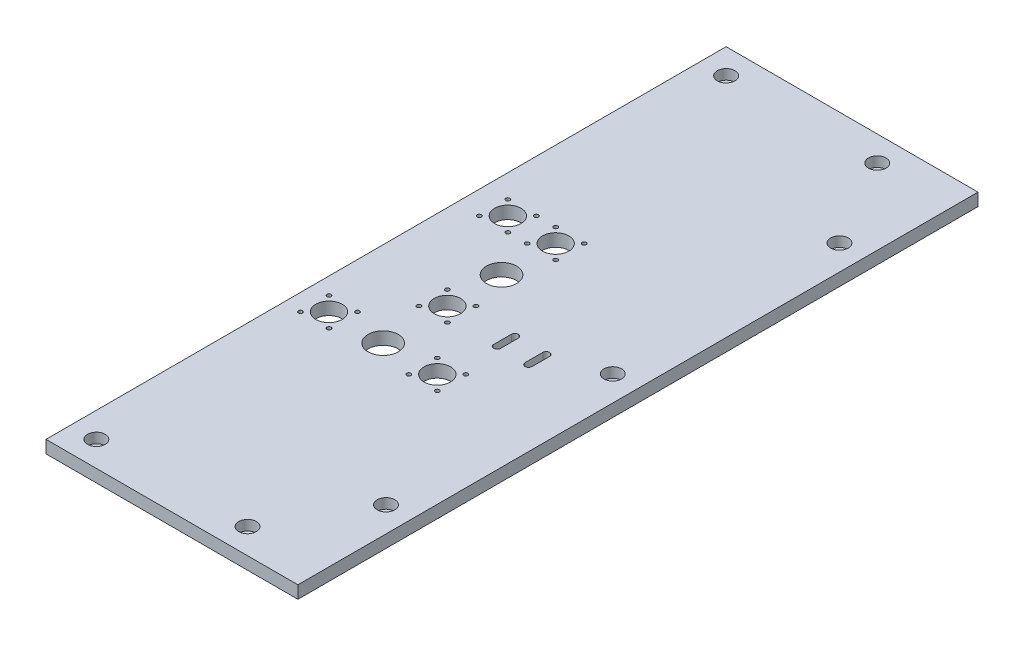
ISO-10303-21;
HEADER;
FILE_DESCRIPTION(('STEP AP214'),'2;1');
FILE_NAME('part.step','',(''),(''),'','','');
FILE_SCHEMA(('AUTOMOTIVE_DESIGN { 1 0 10303 214 1 1 1 1 }'));
ENDSEC;
DATA;
#1=APPLICATION_CONTEXT('core data for automotive mechanical design processes');
#2=APPLICATION_PROTOCOL_DEFINITION('international standard','automotive_design',2000,#1);
#3=PRODUCT_CONTEXT('',#1,'mechanical');
#4=PRODUCT('Part','Part','',(#3));
#5=PRODUCT_RELATED_PRODUCT_CATEGORY('part','',(#4));
#6=PRODUCT_DEFINITION_FORMATION('','',#4);
#7=PRODUCT_DEFINITION_CONTEXT('part definition',#1,'design');
#8=PRODUCT_DEFINITION('design','',#6,#7);
#9=PRODUCT_DEFINITION_SHAPE('','',#8);
#10=(LENGTH_UNIT() NAMED_UNIT(*) SI_UNIT(.MILLI.,.METRE.));
#11=(NAMED_UNIT(*) PLANE_ANGLE_UNIT() SI_UNIT($,.RADIAN.));
#12=(NAMED_UNIT(*) SI_UNIT($,.STERADIAN.) SOLID_ANGLE_UNIT());
#13=UNCERTAINTY_MEASURE_WITH_UNIT(LENGTH_MEASURE(1.E-05),#10,'distance_accuracy_value','');
#14=(GEOMETRIC_REPRESENTATION_CONTEXT(3) GLOBAL_UNCERTAINTY_ASSIGNED_CONTEXT((#13)) GLOBAL_UNIT_ASSIGNED_CONTEXT((#10,
#11,#12)) REPRESENTATION_CONTEXT('',''));
#15=CARTESIAN_POINT('',(0.,0.,0.));
#16=DIRECTION('',(0.,0.,1.));
#17=DIRECTION('',(1.,0.,0.));
#18=AXIS2_PLACEMENT_3D('',#15,#16,#17);
#19=CARTESIAN_POINT('',(-80.0000000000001,2.,-250.));
#20=DIRECTION('',(0.,1.,0.));
#21=DIRECTION('',(0.,0.,1.));
#22=AXIS2_PLACEMENT_3D('',#19,#20,#21);
#23=CYLINDRICAL_SURFACE('',#22,7.00000000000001);
#24=CARTESIAN_POINT('',(-80.0000000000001,10.,-250.));
#25=DIRECTION('',(0.,1.,0.));
#26=DIRECTION('',(0.,0.,1.));
#27=AXIS2_PLACEMENT_3D('',#24,#25,#26);
#28=CIRCLE('',#27,7.00000000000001);
#29=CARTESIAN_POINT('',(-80.0000000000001,10.,-243.));
#30=VERTEX_POINT('',#29);
#31=EDGE_CURVE('E387',#30,#30,#28,.F.);
#32=ORIENTED_EDGE('',*,*,#31,.F.);
#33=EDGE_LOOP('',(#32));
#34=FACE_BOUND('',#33,.T.);
#35=CARTESIAN_POINT('',(-80.0000000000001,2.,-250.));
#36=DIRECTION('',(0.,1.,0.));
#37=DIRECTION('',(0.,0.,1.));
#38=AXIS2_PLACEMENT_3D('',#35,#36,#37);
#39=CIRCLE('',#38,7.00000000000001);
#40=CARTESIAN_POINT('',(-80.0000000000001,2.,-243.));
#41=VERTEX_POINT('',#40);
#42=EDGE_CURVE('E390',#41,#41,#39,.T.);
#43=ORIENTED_EDGE('',*,*,#42,.F.);
#44=EDGE_LOOP('',(#43));
#45=FACE_BOUND('',#44,.T.);
#46=ADVANCED_FACE('F17',(#34,#45),#23,.F.);
#47=CARTESIAN_POINT('',(40.,2.,-250.));
#48=DIRECTION('',(0.,1.,0.));
#49=DIRECTION('',(0.,0.,1.));
#50=AXIS2_PLACEMENT_3D('',#47,#48,#49);
#51=CYLINDRICAL_SURFACE('',#50,7.00000000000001);
#52=CARTESIAN_POINT('',(40.,10.,-250.));
#53=DIRECTION('',(0.,1.,0.));
#54=DIRECTION('',(0.,0.,1.));
#55=AXIS2_PLACEMENT_3D('',#52,#53,#54);
#56=CIRCLE('',#55,7.00000000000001);
#57=CARTESIAN_POINT('',(40.,10.,-243.));
#58=VERTEX_POINT('',#57);
#59=EDGE_CURVE('E384',#58,#58,#56,.F.);
#60=ORIENTED_EDGE('',*,*,#59,.F.);
#61=EDGE_LOOP('',(#60));
#62=FACE_BOUND('',#61,.T.);
#63=CARTESIAN_POINT('',(40.,2.,-250.));
#64=DIRECTION('',(0.,1.,0.));
#65=DIRECTION('',(0.,0.,1.));
#66=AXIS2_PLACEMENT_3D('',#63,#64,#65);
#67=CIRCLE('',#66,7.00000000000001);
#68=CARTESIAN_POINT('',(40.,2.,-243.));
#69=VERTEX_POINT('',#68);
#70=EDGE_CURVE('E393',#69,#69,#67,.T.);
#71=ORIENTED_EDGE('',*,*,#70,.F.);
#72=EDGE_LOOP('',(#71));
#73=FACE_BOUND('',#72,.T.);
#74=ADVANCED_FACE('F416',(#62,#73),#51,.F.);
#75=CARTESIAN_POINT('',(80.,2.,-180.));
#76=DIRECTION('',(0.,1.,0.));
#77=DIRECTION('',(0.,0.,1.));
#78=AXIS2_PLACEMENT_3D('',#75,#76,#77);
#79=CYLINDRICAL_SURFACE('',#78,7.00000000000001);
#80=CARTESIAN_POINT('',(80.,10.,-180.));
#81=DIRECTION('',(0.,1.,0.));
#82=DIRECTION('',(0.,0.,1.));
#83=AXIS2_PLACEMENT_3D('',#80,#81,#82);
#84=CIRCLE('',#83,7.00000000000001);
#85=CARTESIAN_POINT('',(80.,10.,-173.));
#86=VERTEX_POINT('',#85);
#87=EDGE_CURVE('E381',#86,#86,#84,.F.);
#88=ORIENTED_EDGE('',*,*,#87,.F.);
#89=EDGE_LOOP('',(#88));
#90=FACE_BOUND('',#89,.T.);
#91=CARTESIAN_POINT('',(80.,2.,-180.));
#92=DIRECTION('',(0.,1.,0.));
#93=DIRECTION('',(0.,0.,1.));
#94=AXIS2_PLACEMENT_3D('',#91,#92,#93);
#95=CIRCLE('',#94,7.00000000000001);
#96=CARTESIAN_POINT('',(80.,2.,-173.));
#97=VERTEX_POINT('',#96);
#98=EDGE_CURVE('E20',#97,#97,#95,.T.);
#99=ORIENTED_EDGE('',*,*,#98,.F.);
#100=EDGE_LOOP('',(#99));
#101=FACE_BOUND('',#100,.T.);
#102=ADVANCED_FACE('F413',(#90,#101),#79,.F.);
#103=CARTESIAN_POINT('',(80.,2.,0.));
#104=DIRECTION('',(0.,1.,0.));
#105=DIRECTION('',(0.,0.,1.));
#106=AXIS2_PLACEMENT_3D('',#103,#104,#105);
#107=CYLINDRICAL_SURFACE('',#106,7.);
#108=CARTESIAN_POINT('',(80.,10.,0.));
#109=DIRECTION('',(0.,1.,0.));
#110=DIRECTION('',(0.,0.,1.));
#111=AXIS2_PLACEMENT_3D('',#108,#109,#110);
#112=CIRCLE('',#111,7.);
#113=CARTESIAN_POINT('',(80.,10.,6.99999999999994));
#114=VERTEX_POINT('',#113);
#115=EDGE_CURVE('E378',#114,#114,#112,.F.);
#116=ORIENTED_EDGE('',*,*,#115,.F.);
#117=EDGE_LOOP('',(#116));
#118=FACE_BOUND('',#117,.T.);
#119=CARTESIAN_POINT('',(80.,2.,0.));
#120=DIRECTION('',(0.,1.,0.));
#121=DIRECTION('',(0.,0.,1.));
#122=AXIS2_PLACEMENT_3D('',#119,#120,#121);
#123=CIRCLE('',#122,7.);
#124=CARTESIAN_POINT('',(80.,2.,6.99999999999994));
#125=VERTEX_POINT('',#124);
#126=EDGE_CURVE('E404',#125,#125,#123,.T.);
#127=ORIENTED_EDGE('',*,*,#126,.F.);
#128=EDGE_LOOP('',(#127));
#129=FACE_BOUND('',#128,.T.);
#130=ADVANCED_FACE('F415',(#118,#129),#107,.F.);
#131=CARTESIAN_POINT('',(80.0000000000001,2.,180.));
#132=DIRECTION('',(0.,1.,0.));
#133=DIRECTION('',(0.,0.,1.));
#134=AXIS2_PLACEMENT_3D('',#131,#132,#133);
#135=CYLINDRICAL_SURFACE('',#134,7.00000000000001);
#136=CARTESIAN_POINT('',(80.0000000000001,10.,180.));
#137=DIRECTION('',(0.,1.,0.));
#138=DIRECTION('',(0.,0.,1.));
#139=AXIS2_PLACEMENT_3D('',#136,#137,#138);
#140=CIRCLE('',#139,7.00000000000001);
#141=CARTESIAN_POINT('',(80.0000000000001,10.,187.));
#142=VERTEX_POINT('',#141);
#143=EDGE_CURVE('E375',#142,#142,#140,.F.);
#144=ORIENTED_EDGE('',*,*,#143,.F.);
#145=EDGE_LOOP('',(#144));
#146=FACE_BOUND('',#145,.T.);
#147=CARTESIAN_POINT('',(80.0000000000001,2.,180.));
#148=DIRECTION('',(0.,1.,0.));
#149=DIRECTION('',(0.,0.,1.));
#150=AXIS2_PLACEMENT_3D('',#147,#148,#149);
#151=CIRCLE('',#150,7.00000000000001);
#152=CARTESIAN_POINT('',(80.0000000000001,2.,187.));
#153=VERTEX_POINT('',#152);
#154=EDGE_CURVE('E402',#153,#153,#151,.T.);
#155=ORIENTED_EDGE('',*,*,#154,.F.);
#156=EDGE_LOOP('',(#155));
#157=FACE_BOUND('',#156,.T.);
#158=ADVANCED_FACE('F424',(#146,#157),#135,.F.);
#159=CARTESIAN_POINT('',(40.,2.,250.));
#160=DIRECTION('',(0.,1.,0.));
#161=DIRECTION('',(0.,0.,1.));
#162=AXIS2_PLACEMENT_3D('',#159,#160,#161);
#163=CYLINDRICAL_SURFACE('',#162,7.00000000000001);
#164=CARTESIAN_POINT('',(40.,10.,250.));
#165=DIRECTION('',(0.,1.,0.));
#166=DIRECTION('',(0.,0.,1.));
#167=AXIS2_PLACEMENT_3D('',#164,#165,#166);
#168=CIRCLE('',#167,7.00000000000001);
#169=CARTESIAN_POINT('',(40.,10.,257.));
#170=VERTEX_POINT('',#169);
#171=EDGE_CURVE('E372',#170,#170,#168,.F.);
#172=ORIENTED_EDGE('',*,*,#171,.F.);
#173=EDGE_LOOP('',(#172));
#174=FACE_BOUND('',#173,.T.);
#175=CARTESIAN_POINT('',(40.,2.,250.));
#176=DIRECTION('',(0.,1.,0.));
#177=DIRECTION('',(0.,0.,1.));
#178=AXIS2_PLACEMENT_3D('',#175,#176,#177);
#179=CIRCLE('',#178,7.00000000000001);
#180=CARTESIAN_POINT('',(40.,2.,257.));
#181=VERTEX_POINT('',#180);
#182=EDGE_CURVE('E399',#181,#181,#179,.T.);
#183=ORIENTED_EDGE('',*,*,#182,.F.);
#184=EDGE_LOOP('',(#183));
#185=FACE_BOUND('',#184,.T.);
#186=ADVANCED_FACE('F650',(#174,#185),#163,.F.);
#187=CARTESIAN_POINT('',(-80.0000000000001,2.,250.));
#188=DIRECTION('',(0.,1.,0.));
#189=DIRECTION('',(0.,0.,1.));
#190=AXIS2_PLACEMENT_3D('',#187,#188,#189);
#191=CYLINDRICAL_SURFACE('',#190,6.99999999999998);
#192=CARTESIAN_POINT('',(-80.0000000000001,10.,250.));
#193=DIRECTION('',(0.,1.,0.));
#194=DIRECTION('',(0.,0.,1.));
#195=AXIS2_PLACEMENT_3D('',#192,#193,#194);
#196=CIRCLE('',#195,6.99999999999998);
#197=CARTESIAN_POINT('',(-80.0000000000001,10.,257.));
#198=VERTEX_POINT('',#197);
#199=EDGE_CURVE('E369',#198,#198,#196,.F.);
#200=ORIENTED_EDGE('',*,*,#199,.F.);
#201=EDGE_LOOP('',(#200));
#202=FACE_BOUND('',#201,.T.);
#203=CARTESIAN_POINT('',(-80.0000000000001,2.,250.));
#204=DIRECTION('',(0.,1.,0.));
#205=DIRECTION('',(0.,0.,1.));
#206=AXIS2_PLACEMENT_3D('',#203,#204,#205);
#207=CIRCLE('',#206,6.99999999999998);
#208=CARTESIAN_POINT('',(-80.0000000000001,2.,257.));
#209=VERTEX_POINT('',#208);
#210=EDGE_CURVE('E396',#209,#209,#207,.T.);
#211=ORIENTED_EDGE('',*,*,#210,.F.);
#212=EDGE_LOOP('',(#211));
#213=FACE_BOUND('',#212,.T.);
#214=ADVANCED_FACE('F646',(#202,#213),#191,.F.);
#215=CARTESIAN_POINT('',(80.,2.,-180.));
#216=DIRECTION('',(0.,1.,0.));
#217=DIRECTION('',(0.,0.,1.));
#218=AXIS2_PLACEMENT_3D('',#215,#216,#217);
#219=PLANE('',#218);
#220=CARTESIAN_POINT('',(80.,2.,-180.));
#221=DIRECTION('',(0.,1.,0.));
#222=DIRECTION('',(0.,0.,1.));
#223=AXIS2_PLACEMENT_3D('',#220,#221,#222);
#224=CIRCLE('',#223,4.25);
#225=CARTESIAN_POINT('',(80.,2.,-175.75));
#226=VERTEX_POINT('',#225);
#227=EDGE_CURVE('E135',#226,#226,#224,.F.);
#228=ORIENTED_EDGE('',*,*,#227,.T.);
#229=EDGE_LOOP('',(#228));
#230=FACE_BOUND('',#229,.T.);
#231=ORIENTED_EDGE('',*,*,#98,.T.);
#232=EDGE_LOOP('',(#231));
#233=FACE_BOUND('',#232,.T.);
#234=ADVANCED_FACE('F411',(#230,#233),#219,.T.);
#235=CARTESIAN_POINT('',(80.,2.,0.));
#236=DIRECTION('',(0.,1.,0.));
#237=DIRECTION('',(0.,0.,1.));
#238=AXIS2_PLACEMENT_3D('',#235,#236,#237);
#239=PLANE('',#238);
#240=CARTESIAN_POINT('',(80.,2.,0.));
#241=DIRECTION('',(0.,1.,0.));
#242=DIRECTION('',(0.,0.,1.));
#243=AXIS2_PLACEMENT_3D('',#240,#241,#242);
#244=CIRCLE('',#243,4.25000000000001);
#245=CARTESIAN_POINT('',(80.,2.,4.24999999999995));
#246=VERTEX_POINT('',#245);
#247=EDGE_CURVE('E343',#246,#246,#244,.F.);
#248=ORIENTED_EDGE('',*,*,#247,.T.);
#249=EDGE_LOOP('',(#248));
#250=FACE_BOUND('',#249,.T.);
#251=ORIENTED_EDGE('',*,*,#126,.T.);
#252=EDGE_LOOP('',(#251));
#253=FACE_BOUND('',#252,.T.);
#254=ADVANCED_FACE('F639',(#250,#253),#239,.T.);
#255=CARTESIAN_POINT('',(80.0000000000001,2.,180.));
#256=DIRECTION('',(0.,1.,0.));
#257=DIRECTION('',(0.,0.,1.));
#258=AXIS2_PLACEMENT_3D('',#255,#256,#257);
#259=PLANE('',#258);
#260=CARTESIAN_POINT('',(80.0000000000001,2.,180.));
#261=DIRECTION('',(0.,1.,0.));
#262=DIRECTION('',(0.,0.,1.));
#263=AXIS2_PLACEMENT_3D('',#260,#261,#262);
#264=CIRCLE('',#263,4.25);
#265=CARTESIAN_POINT('',(80.0000000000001,2.,184.25));
#266=VERTEX_POINT('',#265);
#267=EDGE_CURVE('E340',#266,#266,#264,.F.);
#268=ORIENTED_EDGE('',*,*,#267,.T.);
#269=EDGE_LOOP('',(#268));
#270=FACE_BOUND('',#269,.T.);
#271=ORIENTED_EDGE('',*,*,#154,.T.);
#272=EDGE_LOOP('',(#271));
#273=FACE_BOUND('',#272,.T.);
#274=ADVANCED_FACE('F635',(#270,#273),#259,.T.);
#275=CARTESIAN_POINT('',(40.,2.,250.));
#276=DIRECTION('',(0.,1.,0.));
#277=DIRECTION('',(0.,0.,1.));
#278=AXIS2_PLACEMENT_3D('',#275,#276,#277);
#279=PLANE('',#278);
#280=CARTESIAN_POINT('',(40.,2.,250.));
#281=DIRECTION('',(0.,1.,0.));
#282=DIRECTION('',(0.,0.,1.));
#283=AXIS2_PLACEMENT_3D('',#280,#281,#282);
#284=CIRCLE('',#283,4.25000000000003);
#285=CARTESIAN_POINT('',(40.,2.,254.25));
#286=VERTEX_POINT('',#285);
#287=EDGE_CURVE('E337',#286,#286,#284,.F.);
#288=ORIENTED_EDGE('',*,*,#287,.T.);
#289=EDGE_LOOP('',(#288));
#290=FACE_BOUND('',#289,.T.);
#291=ORIENTED_EDGE('',*,*,#182,.T.);
#292=EDGE_LOOP('',(#291));
#293=FACE_BOUND('',#292,.T.);
#294=ADVANCED_FACE('F631',(#290,#293),#279,.T.);
#295=CARTESIAN_POINT('',(-80.0000000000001,2.,250.));
#296=DIRECTION('',(0.,1.,0.));
#297=DIRECTION('',(0.,0.,1.));
#298=AXIS2_PLACEMENT_3D('',#295,#296,#297);
#299=PLANE('',#298);
#300=CARTESIAN_POINT('',(-80.0000000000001,2.,250.));
#301=DIRECTION('',(0.,1.,0.));
#302=DIRECTION('',(0.,0.,1.));
#303=AXIS2_PLACEMENT_3D('',#300,#301,#302);
#304=CIRCLE('',#303,4.25);
#305=CARTESIAN_POINT('',(-80.0000000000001,2.,254.25));
#306=VERTEX_POINT('',#305);
#307=EDGE_CURVE('E334',#306,#306,#304,.F.);
#308=ORIENTED_EDGE('',*,*,#307,.T.);
#309=EDGE_LOOP('',(#308));
#310=FACE_BOUND('',#309,.T.);
#311=ORIENTED_EDGE('',*,*,#210,.T.);
#312=EDGE_LOOP('',(#311));
#313=FACE_BOUND('',#312,.T.);
#314=ADVANCED_FACE('F627',(#310,#313),#299,.T.);
#315=CARTESIAN_POINT('',(40.,2.,-250.));
#316=DIRECTION('',(0.,1.,0.));
#317=DIRECTION('',(0.,0.,1.));
#318=AXIS2_PLACEMENT_3D('',#315,#316,#317);
#319=PLANE('',#318);
#320=CARTESIAN_POINT('',(40.,2.,-250.));
#321=DIRECTION('',(0.,1.,0.));
#322=DIRECTION('',(0.,0.,1.));
#323=AXIS2_PLACEMENT_3D('',#320,#321,#322);
#324=CIRCLE('',#323,4.25);
#325=CARTESIAN_POINT('',(40.,2.,-245.75));
#326=VERTEX_POINT('',#325);
#327=EDGE_CURVE('E331',#326,#326,#324,.F.);
#328=ORIENTED_EDGE('',*,*,#327,.T.);
#329=EDGE_LOOP('',(#328));
#330=FACE_BOUND('',#329,.T.);
#331=ORIENTED_EDGE('',*,*,#70,.T.);
#332=EDGE_LOOP('',(#331));
#333=FACE_BOUND('',#332,.T.);
#334=ADVANCED_FACE('F623',(#330,#333),#319,.T.);
#335=CARTESIAN_POINT('',(-80.0000000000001,2.,-250.));
#336=DIRECTION('',(0.,1.,0.));
#337=DIRECTION('',(0.,0.,1.));
#338=AXIS2_PLACEMENT_3D('',#335,#336,#337);
#339=PLANE('',#338);
#340=CARTESIAN_POINT('',(-80.0000000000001,2.,-250.));
#341=DIRECTION('',(0.,1.,0.));
#342=DIRECTION('',(0.,0.,1.));
#343=AXIS2_PLACEMENT_3D('',#340,#341,#342);
#344=CIRCLE('',#343,4.25);
#345=CARTESIAN_POINT('',(-80.0000000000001,2.,-245.75));
#346=VERTEX_POINT('',#345);
#347=EDGE_CURVE('E328',#346,#346,#344,.F.);
#348=ORIENTED_EDGE('',*,*,#347,.T.);
#349=EDGE_LOOP('',(#348));
#350=FACE_BOUND('',#349,.T.);
#351=ORIENTED_EDGE('',*,*,#42,.T.);
#352=EDGE_LOOP('',(#351));
#353=FACE_BOUND('',#352,.T.);
#354=ADVANCED_FACE('F619',(#350,#353),#339,.T.);
#355=CARTESIAN_POINT('',(0.,10.,0.));
#356=DIRECTION('',(0.,1.,0.));
#357=DIRECTION('',(0.,0.,1.));
#358=AXIS2_PLACEMENT_3D('',#355,#356,#357);
#359=PLANE('',#358);
#360=DIRECTION('',(0.,0.,-1.));
#361=VECTOR('',#360,1.);
#362=CARTESIAN_POINT('',(-100.,10.,-270.));
#363=LINE('',#362,#361);
#364=CARTESIAN_POINT('',(-100.,10.,-270.));
#365=VERTEX_POINT('',#364);
#366=CARTESIAN_POINT('',(-100.,10.,270.));
#367=VERTEX_POINT('',#366);
#368=EDGE_CURVE('E707',#365,#367,#363,.F.);
#369=ORIENTED_EDGE('',*,*,#368,.T.);
#370=DIRECTION('',(-1.,0.,0.));
#371=VECTOR('',#370,1.);
#372=CARTESIAN_POINT('',(-100.,10.,270.));
#373=LINE('',#372,#371);
#374=CARTESIAN_POINT('',(100.,10.,270.));
#375=VERTEX_POINT('',#374);
#376=EDGE_CURVE('E702',#367,#375,#373,.F.);
#377=ORIENTED_EDGE('',*,*,#376,.T.);
#378=DIRECTION('',(0.,0.,1.));
#379=VECTOR('',#378,1.);
#380=CARTESIAN_POINT('',(99.9999999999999,10.,-270.));
#381=LINE('',#380,#379);
#382=CARTESIAN_POINT('',(100.,10.,-270.));
#383=VERTEX_POINT('',#382);
#384=EDGE_CURVE('E698',#375,#383,#381,.F.);
#385=ORIENTED_EDGE('',*,*,#384,.T.);
#386=DIRECTION('',(1.,0.,0.));
#387=VECTOR('',#386,1.);
#388=CARTESIAN_POINT('',(-100.,10.,-270.));
#389=LINE('',#388,#387);
#390=EDGE_CURVE('E264',#383,#365,#389,.F.);
#391=ORIENTED_EDGE('',*,*,#390,.T.);
#392=EDGE_LOOP('',(#369,#377,#385,#391));
#393=FACE_BOUND('',#392,.T.);
#394=CARTESIAN_POINT('',(-75.3118836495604,10.,69.9999999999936));
#395=DIRECTION('',(0.,-1.,0.));
#396=DIRECTION('',(0.,0.,-1.));
#397=AXIS2_PLACEMENT_3D('',#394,#395,#396);
#398=CIRCLE('',#397,10.5);
#399=CARTESIAN_POINT('',(-75.3118836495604,10.,59.4999999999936));
#400=VERTEX_POINT('',#399);
#401=EDGE_CURVE('E261',#400,#400,#398,.T.);
#402=ORIENTED_EDGE('',*,*,#401,.T.);
#403=EDGE_LOOP('',(#402));
#404=FACE_BOUND('',#403,.T.);
#405=CARTESIAN_POINT('',(10.6881163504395,10.,69.9999999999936));
#406=DIRECTION('',(0.,-1.,0.));
#407=DIRECTION('',(0.,0.,-1.));
#408=AXIS2_PLACEMENT_3D('',#405,#406,#407);
#409=CIRCLE('',#408,10.5);
#410=CARTESIAN_POINT('',(10.6881163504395,10.,59.4999999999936));
#411=VERTEX_POINT('',#410);
#412=EDGE_CURVE('E265',#411,#411,#409,.T.);
#413=ORIENTED_EDGE('',*,*,#412,.T.);
#414=EDGE_LOOP('',(#413));
#415=FACE_BOUND('',#414,.T.);
#416=CARTESIAN_POINT('',(-32.3118836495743,10.,18.9999999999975));
#417=DIRECTION('',(0.,-1.,0.));
#418=DIRECTION('',(0.,0.,-1.));
#419=AXIS2_PLACEMENT_3D('',#416,#417,#418);
#420=CIRCLE('',#419,10.5);
#421=CARTESIAN_POINT('',(-32.3118836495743,10.,8.49999999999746));
#422=VERTEX_POINT('',#421);
#423=EDGE_CURVE('E268',#422,#422,#420,.T.);
#424=ORIENTED_EDGE('',*,*,#423,.T.);
#425=EDGE_LOOP('',(#424));
#426=FACE_BOUND('',#425,.T.);
#427=CARTESIAN_POINT('',(-32.3118836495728,10.,-24.0000000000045));
#428=DIRECTION('',(0.,-1.,0.));
#429=DIRECTION('',(0.,0.,-1.));
#430=AXIS2_PLACEMENT_3D('',#427,#428,#429);
#431=CIRCLE('',#430,12.);
#432=CARTESIAN_POINT('',(-32.3118836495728,10.,-36.0000000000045));
#433=VERTEX_POINT('',#432);
#434=EDGE_CURVE('E271',#433,#433,#431,.T.);
#435=ORIENTED_EDGE('',*,*,#434,.T.);
#436=EDGE_LOOP('',(#435));
#437=FACE_BOUND('',#436,.T.);
#438=CARTESIAN_POINT('',(-32.3118836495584,10.,69.999999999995));
#439=DIRECTION('',(0.,-1.,0.));
#440=DIRECTION('',(0.,0.,-1.));
#441=AXIS2_PLACEMENT_3D('',#438,#439,#440);
#442=CIRCLE('',#441,12.);
#443=CARTESIAN_POINT('',(-32.3118836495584,10.,57.999999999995));
#444=VERTEX_POINT('',#443);
#445=EDGE_CURVE('E274',#444,#444,#442,.T.);
#446=ORIENTED_EDGE('',*,*,#445,.T.);
#447=EDGE_LOOP('',(#446));
#448=FACE_BOUND('',#447,.T.);
#449=CARTESIAN_POINT('',(-32.3118836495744,10.,-67.0000000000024));
#450=DIRECTION('',(0.,-1.,0.));
#451=DIRECTION('',(0.,0.,-1.));
#452=AXIS2_PLACEMENT_3D('',#449,#450,#451);
#453=CIRCLE('',#452,10.5);
#454=CARTESIAN_POINT('',(-32.3118836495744,10.,-77.5000000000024));
#455=VERTEX_POINT('',#454);
#456=EDGE_CURVE('E277',#455,#455,#453,.T.);
#457=ORIENTED_EDGE('',*,*,#456,.T.);
#458=EDGE_LOOP('',(#457));
#459=FACE_BOUND('',#458,.T.);
#460=CARTESIAN_POINT('',(-20.9981751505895,10.,-78.313708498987));
#461=DIRECTION('',(0.,1.,0.));
#462=DIRECTION('',(0.,0.,1.));
#463=AXIS2_PLACEMENT_3D('',#460,#461,#462);
#464=CIRCLE('',#463,1.65);
#465=CARTESIAN_POINT('',(-20.9981751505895,10.,-76.663708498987));
#466=VERTEX_POINT('',#465);
#467=EDGE_CURVE('E280',#466,#466,#464,.F.);
#468=ORIENTED_EDGE('',*,*,#467,.T.);
#469=EDGE_LOOP('',(#468));
#470=FACE_BOUND('',#469,.T.);
#471=CARTESIAN_POINT('',(-43.6255921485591,10.,-78.3137084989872));
#472=DIRECTION('',(0.,1.,0.));
#473=DIRECTION('',(0.,0.,1.));
#474=AXIS2_PLACEMENT_3D('',#471,#472,#473);
#475=CIRCLE('',#474,1.65);
#476=CARTESIAN_POINT('',(-43.6255921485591,10.,-76.6637084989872));
#477=VERTEX_POINT('',#476);
#478=EDGE_CURVE('E283',#477,#477,#475,.F.);
#479=ORIENTED_EDGE('',*,*,#478,.T.);
#480=EDGE_LOOP('',(#479));
#481=FACE_BOUND('',#480,.T.);
#482=CARTESIAN_POINT('',(-43.6255921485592,10.,-55.6862915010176));
#483=DIRECTION('',(0.,1.,0.));
#484=DIRECTION('',(0.,0.,1.));
#485=AXIS2_PLACEMENT_3D('',#482,#483,#484);
#486=CIRCLE('',#485,1.64999999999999);
#487=CARTESIAN_POINT('',(-43.6255921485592,10.,-54.0362915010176));
#488=VERTEX_POINT('',#487);
#489=EDGE_CURVE('E286',#488,#488,#486,.F.);
#490=ORIENTED_EDGE('',*,*,#489,.T.);
#491=EDGE_LOOP('',(#490));
#492=FACE_BOUND('',#491,.T.);
#493=CARTESIAN_POINT('',(-20.9981751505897,10.,-55.6862915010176));
#494=DIRECTION('',(0.,1.,0.));
#495=DIRECTION('',(0.,0.,1.));
#496=AXIS2_PLACEMENT_3D('',#493,#494,#495);
#497=CIRCLE('',#496,1.64999999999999);
#498=CARTESIAN_POINT('',(-20.9981751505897,10.,-54.0362915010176));
#499=VERTEX_POINT('',#498);
#500=EDGE_CURVE('E289',#499,#499,#497,.F.);
#501=ORIENTED_EDGE('',*,*,#500,.T.);
#502=EDGE_LOOP('',(#501));
#503=FACE_BOUND('',#502,.T.);
#504=CARTESIAN_POINT('',(-20.9981751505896,10.,30.3137084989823));
#505=DIRECTION('',(0.,1.,0.));
#506=DIRECTION('',(0.,0.,1.));
#507=AXIS2_PLACEMENT_3D('',#504,#505,#506);
#508=CIRCLE('',#507,1.64999999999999);
#509=CARTESIAN_POINT('',(-20.9981751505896,10.,31.9637084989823));
#510=VERTEX_POINT('',#509);
#511=EDGE_CURVE('E292',#510,#510,#508,.F.);
#512=ORIENTED_EDGE('',*,*,#511,.T.);
#513=EDGE_LOOP('',(#512));
#514=FACE_BOUND('',#513,.T.);
#515=CARTESIAN_POINT('',(-43.6255921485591,10.,30.3137084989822));
#516=DIRECTION('',(0.,1.,0.));
#517=DIRECTION('',(0.,0.,1.));
#518=AXIS2_PLACEMENT_3D('',#515,#516,#517);
#519=CIRCLE('',#518,1.64999999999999);
#520=CARTESIAN_POINT('',(-43.6255921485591,10.,31.9637084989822));
#521=VERTEX_POINT('',#520);
#522=EDGE_CURVE('E295',#521,#521,#519,.F.);
#523=ORIENTED_EDGE('',*,*,#522,.T.);
#524=EDGE_LOOP('',(#523));
#525=FACE_BOUND('',#524,.T.);
#526=CARTESIAN_POINT('',(-43.625592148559,10.,7.68629150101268));
#527=DIRECTION('',(0.,1.,0.));
#528=DIRECTION('',(0.,0.,1.));
#529=AXIS2_PLACEMENT_3D('',#526,#527,#528);
#530=CIRCLE('',#529,1.64999999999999);
#531=CARTESIAN_POINT('',(-43.625592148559,10.,9.33629150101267));
#532=VERTEX_POINT('',#531);
#533=EDGE_CURVE('E298',#532,#532,#530,.F.);
#534=ORIENTED_EDGE('',*,*,#533,.T.);
#535=EDGE_LOOP('',(#534));
#536=FACE_BOUND('',#535,.T.);
#537=CARTESIAN_POINT('',(-20.9981751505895,10.,7.68629150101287));
#538=DIRECTION('',(0.,1.,0.));
#539=DIRECTION('',(0.,0.,1.));
#540=AXIS2_PLACEMENT_3D('',#537,#538,#539);
#541=CIRCLE('',#540,1.64999999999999);
#542=CARTESIAN_POINT('',(-20.9981751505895,10.,9.33629150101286));
#543=VERTEX_POINT('',#542);
#544=EDGE_CURVE('E301',#543,#543,#541,.F.);
#545=ORIENTED_EDGE('',*,*,#544,.T.);
#546=EDGE_LOOP('',(#545));
#547=FACE_BOUND('',#546,.T.);
#548=CARTESIAN_POINT('',(22.0018248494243,10.,58.6862915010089));
#549=DIRECTION('',(0.,1.,0.));
#550=DIRECTION('',(0.,0.,1.));
#551=AXIS2_PLACEMENT_3D('',#548,#549,#550);
#552=CIRCLE('',#551,1.64999999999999);
#553=CARTESIAN_POINT('',(22.0018248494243,10.,60.3362915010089));
#554=VERTEX_POINT('',#553);
#555=EDGE_CURVE('E304',#554,#554,#552,.F.);
#556=ORIENTED_EDGE('',*,*,#555,.T.);
#557=EDGE_LOOP('',(#556));
#558=FACE_BOUND('',#557,.T.);
#559=CARTESIAN_POINT('',(22.0018248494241,10.,81.3137084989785));
#560=DIRECTION('',(0.,1.,0.));
#561=DIRECTION('',(0.,0.,1.));
#562=AXIS2_PLACEMENT_3D('',#559,#560,#561);
#563=CIRCLE('',#562,1.65);
#564=CARTESIAN_POINT('',(22.0018248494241,10.,82.9637084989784));
#565=VERTEX_POINT('',#564);
#566=EDGE_CURVE('E307',#565,#565,#563,.F.);
#567=ORIENTED_EDGE('',*,*,#566,.T.);
#568=EDGE_LOOP('',(#567));
#569=FACE_BOUND('',#568,.T.);
#570=CARTESIAN_POINT('',(-0.625592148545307,10.,81.3137084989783));
#571=DIRECTION('',(0.,1.,0.));
#572=DIRECTION('',(0.,0.,1.));
#573=AXIS2_PLACEMENT_3D('',#570,#571,#572);
#574=CIRCLE('',#573,1.65);
#575=CARTESIAN_POINT('',(-0.625592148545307,10.,82.9637084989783));
#576=VERTEX_POINT('',#575);
#577=EDGE_CURVE('E310',#576,#576,#574,.F.);
#578=ORIENTED_EDGE('',*,*,#577,.T.);
#579=EDGE_LOOP('',(#578));
#580=FACE_BOUND('',#579,.T.);
#581=CARTESIAN_POINT('',(-0.625592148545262,10.,58.6862915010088));
#582=DIRECTION('',(0.,1.,0.));
#583=DIRECTION('',(0.,0.,1.));
#584=AXIS2_PLACEMENT_3D('',#581,#582,#583);
#585=CIRCLE('',#584,1.64999999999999);
#586=CARTESIAN_POINT('',(-0.625592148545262,10.,60.3362915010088));
#587=VERTEX_POINT('',#586);
#588=EDGE_CURVE('E313',#587,#587,#585,.F.);
#589=ORIENTED_EDGE('',*,*,#588,.T.);
#590=EDGE_LOOP('',(#589));
#591=FACE_BOUND('',#590,.T.);
#592=CARTESIAN_POINT('',(-86.6255921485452,10.,81.3137084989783));
#593=DIRECTION('',(0.,1.,0.));
#594=DIRECTION('',(0.,0.,1.));
#595=AXIS2_PLACEMENT_3D('',#592,#593,#594);
#596=CIRCLE('',#595,1.65);
#597=CARTESIAN_POINT('',(-86.6255921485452,10.,82.9637084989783));
#598=VERTEX_POINT('',#597);
#599=EDGE_CURVE('E316',#598,#598,#596,.F.);
#600=ORIENTED_EDGE('',*,*,#599,.T.);
#601=EDGE_LOOP('',(#600));
#602=FACE_BOUND('',#601,.T.);
#603=CARTESIAN_POINT('',(-63.9981751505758,10.,81.3137084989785));
#604=DIRECTION('',(0.,1.,0.));
#605=DIRECTION('',(0.,0.,1.));
#606=AXIS2_PLACEMENT_3D('',#603,#604,#605);
#607=CIRCLE('',#606,1.64999999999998);
#608=CARTESIAN_POINT('',(-63.9981751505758,10.,82.9637084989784));
#609=VERTEX_POINT('',#608);
#610=EDGE_CURVE('E319',#609,#609,#607,.F.);
#611=ORIENTED_EDGE('',*,*,#610,.T.);
#612=EDGE_LOOP('',(#611));
#613=FACE_BOUND('',#612,.T.);
#614=CARTESIAN_POINT('',(-63.9981751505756,10.,58.6862915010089));
#615=DIRECTION('',(0.,1.,0.));
#616=DIRECTION('',(0.,0.,1.));
#617=AXIS2_PLACEMENT_3D('',#614,#615,#616);
#618=CIRCLE('',#617,1.64999999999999);
#619=CARTESIAN_POINT('',(-63.9981751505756,10.,60.3362915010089));
#620=VERTEX_POINT('',#619);
#621=EDGE_CURVE('E322',#620,#620,#618,.F.);
#622=ORIENTED_EDGE('',*,*,#621,.T.);
#623=EDGE_LOOP('',(#622));
#624=FACE_BOUND('',#623,.T.);
#625=CARTESIAN_POINT('',(-86.6255921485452,10.,58.6862915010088));
#626=DIRECTION('',(0.,1.,0.));
#627=DIRECTION('',(0.,0.,1.));
#628=AXIS2_PLACEMENT_3D('',#625,#626,#627);
#629=CIRCLE('',#628,1.64999999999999);
#630=CARTESIAN_POINT('',(-86.6255921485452,10.,60.3362915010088));
#631=VERTEX_POINT('',#630);
#632=EDGE_CURVE('E325',#631,#631,#629,.F.);
#633=ORIENTED_EDGE('',*,*,#632,.T.);
#634=EDGE_LOOP('',(#633));
#635=FACE_BOUND('',#634,.T.);
#636=ORIENTED_EDGE('',*,*,#199,.T.);
#637=EDGE_LOOP('',(#636));
#638=FACE_BOUND('',#637,.T.);
#639=ORIENTED_EDGE('',*,*,#171,.T.);
#640=EDGE_LOOP('',(#639));
#641=FACE_BOUND('',#640,.T.);
#642=ORIENTED_EDGE('',*,*,#143,.T.);
#643=EDGE_LOOP('',(#642));
#644=FACE_BOUND('',#643,.T.);
#645=ORIENTED_EDGE('',*,*,#115,.T.);
#646=EDGE_LOOP('',(#645));
#647=FACE_BOUND('',#646,.T.);
#648=ORIENTED_EDGE('',*,*,#87,.T.);
#649=EDGE_LOOP('',(#648));
#650=FACE_BOUND('',#649,.T.);
#651=ORIENTED_EDGE('',*,*,#59,.T.);
#652=EDGE_LOOP('',(#651));
#653=FACE_BOUND('',#652,.T.);
#654=ORIENTED_EDGE('',*,*,#31,.T.);
#655=EDGE_LOOP('',(#654));
#656=FACE_BOUND('',#655,.T.);
#657=CARTESIAN_POINT('',(15.1881163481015,10.,26.9999999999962));
#658=DIRECTION('',(0.,1.,0.));
#659=DIRECTION('',(0.,0.,1.));
#660=AXIS2_PLACEMENT_3D('',#657,#658,#659);
#661=CIRCLE('',#660,2.75);
#662=CARTESIAN_POINT('',(17.9381163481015,10.,26.9999999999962));
#663=VERTEX_POINT('',#662);
#664=CARTESIAN_POINT('',(12.4381163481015,10.,26.9999999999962));
#665=VERTEX_POINT('',#664);
#666=EDGE_CURVE('E141',#663,#665,#661,.F.);
#667=ORIENTED_EDGE('',*,*,#666,.T.);
#668=DIRECTION('',(0.,0.,1.));
#669=VECTOR('',#668,1.);
#670=CARTESIAN_POINT('',(12.4381163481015,10.,12.9999999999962));
#671=LINE('',#670,#669);
#672=CARTESIAN_POINT('',(12.4381163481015,10.,12.9999999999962));
#673=VERTEX_POINT('',#672);
#674=EDGE_CURVE('E137',#665,#673,#671,.F.);
#675=ORIENTED_EDGE('',*,*,#674,.T.);
#676=CARTESIAN_POINT('',(15.1881163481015,10.,12.9999999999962));
#677=DIRECTION('',(0.,1.,0.));
#678=DIRECTION('',(0.,0.,1.));
#679=AXIS2_PLACEMENT_3D('',#676,#677,#678);
#680=CIRCLE('',#679,2.75);
#681=CARTESIAN_POINT('',(17.9381163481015,10.,12.9999999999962));
#682=VERTEX_POINT('',#681);
#683=EDGE_CURVE('E348',#673,#682,#680,.F.);
#684=ORIENTED_EDGE('',*,*,#683,.T.);
#685=DIRECTION('',(0.,0.,-1.));
#686=VECTOR('',#685,1.);
#687=CARTESIAN_POINT('',(17.9381163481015,10.,12.9999999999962));
#688=LINE('',#687,#686);
#689=EDGE_CURVE('E132',#682,#663,#688,.F.);
#690=ORIENTED_EDGE('',*,*,#689,.T.);
#691=EDGE_LOOP('',(#667,#675,#684,#690));
#692=FACE_BOUND('',#691,.T.);
#693=CARTESIAN_POINT('',(40.1881163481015,10.,26.9999999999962));
#694=DIRECTION('',(0.,1.,0.));
#695=DIRECTION('',(0.,0.,1.));
#696=AXIS2_PLACEMENT_3D('',#693,#694,#695);
#697=CIRCLE('',#696,2.74999999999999);
#698=CARTESIAN_POINT('',(42.9381163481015,10.,26.9999999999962));
#699=VERTEX_POINT('',#698);
#700=CARTESIAN_POINT('',(37.4381163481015,10.,26.9999999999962));
#701=VERTEX_POINT('',#700);
#702=EDGE_CURVE('E103',#699,#701,#697,.F.);
#703=ORIENTED_EDGE('',*,*,#702,.T.);
#704=DIRECTION('',(0.,0.,1.));
#705=VECTOR('',#704,1.);
#706=CARTESIAN_POINT('',(37.4381163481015,10.,12.9999999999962));
#707=LINE('',#706,#705);
#708=CARTESIAN_POINT('',(37.4381163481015,10.,12.9999999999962));
#709=VERTEX_POINT('',#708);
#710=EDGE_CURVE('E107',#701,#709,#707,.F.);
#711=ORIENTED_EDGE('',*,*,#710,.T.);
#712=CARTESIAN_POINT('',(40.1881163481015,10.,12.9999999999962));
#713=DIRECTION('',(0.,1.,0.));
#714=DIRECTION('',(0.,0.,1.));
#715=AXIS2_PLACEMENT_3D('',#712,#713,#714);
#716=CIRCLE('',#715,2.74999999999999);
#717=CARTESIAN_POINT('',(42.9381163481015,10.,12.9999999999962));
#718=VERTEX_POINT('',#717);
#719=EDGE_CURVE('E352',#709,#718,#716,.F.);
#720=ORIENTED_EDGE('',*,*,#719,.T.);
#721=DIRECTION('',(0.,0.,-1.));
#722=VECTOR('',#721,1.);
#723=CARTESIAN_POINT('',(42.9381163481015,10.,12.9999999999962));
#724=LINE('',#723,#722);
#725=EDGE_CURVE('E110',#718,#699,#724,.F.);
#726=ORIENTED_EDGE('',*,*,#725,.T.);
#727=EDGE_LOOP('',(#703,#711,#720,#726));
#728=FACE_BOUND('',#727,.T.);
#729=CARTESIAN_POINT('',(-70.3118836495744,10.,-67.0000000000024));
#730=DIRECTION('',(0.,1.,0.));
#731=DIRECTION('',(0.,0.,1.));
#732=AXIS2_PLACEMENT_3D('',#729,#730,#731);
#733=CIRCLE('',#732,10.5);
#734=CARTESIAN_POINT('',(-70.3118836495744,10.,-56.5000000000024));
#735=VERTEX_POINT('',#734);
#736=EDGE_CURVE('E116',#735,#735,#733,.F.);
#737=ORIENTED_EDGE('',*,*,#736,.T.);
#738=EDGE_LOOP('',(#737));
#739=FACE_BOUND('',#738,.T.);
#740=CARTESIAN_POINT('',(-81.6255921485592,10.,-78.3137084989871));
#741=DIRECTION('',(0.,1.,0.));
#742=DIRECTION('',(0.,0.,1.));
#743=AXIS2_PLACEMENT_3D('',#740,#741,#742);
#744=CIRCLE('',#743,1.64999999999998);
#745=CARTESIAN_POINT('',(-81.6255921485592,10.,-76.6637084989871));
#746=VERTEX_POINT('',#745);
#747=EDGE_CURVE('E357',#746,#746,#744,.F.);
#748=ORIENTED_EDGE('',*,*,#747,.T.);
#749=EDGE_LOOP('',(#748));
#750=FACE_BOUND('',#749,.T.);
#751=CARTESIAN_POINT('',(-81.625592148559,10.,-55.6862915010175));
#752=DIRECTION('',(0.,1.,0.));
#753=DIRECTION('',(0.,0.,1.));
#754=AXIS2_PLACEMENT_3D('',#751,#752,#753);
#755=CIRCLE('',#754,1.64999999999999);
#756=CARTESIAN_POINT('',(-81.625592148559,10.,-54.0362915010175));
#757=VERTEX_POINT('',#756);
#758=EDGE_CURVE('E360',#757,#757,#755,.F.);
#759=ORIENTED_EDGE('',*,*,#758,.T.);
#760=EDGE_LOOP('',(#759));
#761=FACE_BOUND('',#760,.T.);
#762=CARTESIAN_POINT('',(-58.9981751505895,10.,-55.6862915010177));
#763=DIRECTION('',(0.,1.,0.));
#764=DIRECTION('',(0.,0.,1.));
#765=AXIS2_PLACEMENT_3D('',#762,#763,#764);
#766=CIRCLE('',#765,1.64999999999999);
#767=CARTESIAN_POINT('',(-58.9981751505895,10.,-54.0362915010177));
#768=VERTEX_POINT('',#767);
#769=EDGE_CURVE('E363',#768,#768,#766,.F.);
#770=ORIENTED_EDGE('',*,*,#769,.T.);
#771=EDGE_LOOP('',(#770));
#772=FACE_BOUND('',#771,.T.);
#773=CARTESIAN_POINT('',(-58.9981751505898,10.,-78.3137084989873));
#774=DIRECTION('',(0.,1.,0.));
#775=DIRECTION('',(0.,0.,1.));
#776=AXIS2_PLACEMENT_3D('',#773,#774,#775);
#777=CIRCLE('',#776,1.65);
#778=CARTESIAN_POINT('',(-58.9981751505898,10.,-76.6637084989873));
#779=VERTEX_POINT('',#778);
#780=EDGE_CURVE('E366',#779,#779,#777,.F.);
#781=ORIENTED_EDGE('',*,*,#780,.T.);
#782=EDGE_LOOP('',(#781));
#783=FACE_BOUND('',#782,.T.);
#784=ADVANCED_FACE('F105',(#393,#404,#415,#426,#437,#448,#459,#470,#481,#492,#503,#514,#525,
#536,#547,#558,#569,#580,#591,#602,#613,#624,#635,#638,#641,#644,#647,#650,#653,#656,#692,#728,
#739,#750,#761,#772,#783),#359,.T.);
#785=CARTESIAN_POINT('',(-58.9981751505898,10.,-78.3137084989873));
#786=DIRECTION('',(0.,1.,0.));
#787=DIRECTION('',(0.,0.,1.));
#788=AXIS2_PLACEMENT_3D('',#785,#786,#787);
#789=CYLINDRICAL_SURFACE('',#788,1.65);
#790=CARTESIAN_POINT('',(-58.9981751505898,0.,-78.3137084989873));
#791=DIRECTION('',(0.,1.,0.));
#792=DIRECTION('',(0.,0.,1.));
#793=AXIS2_PLACEMENT_3D('',#790,#791,#792);
#794=CIRCLE('',#793,1.65);
#795=CARTESIAN_POINT('',(-58.9981751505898,0.,-76.6637084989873));
#796=VERTEX_POINT('',#795);
#797=EDGE_CURVE('E257',#796,#796,#794,.F.);
#798=ORIENTED_EDGE('',*,*,#797,.T.);
#799=EDGE_LOOP('',(#798));
#800=FACE_BOUND('',#799,.T.);
#801=ORIENTED_EDGE('',*,*,#780,.F.);
#802=EDGE_LOOP('',(#801));
#803=FACE_BOUND('',#802,.T.);
#804=ADVANCED_FACE('F612',(#800,#803),#789,.F.);
#805=CARTESIAN_POINT('',(-58.9981751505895,10.,-55.6862915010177));
#806=DIRECTION('',(0.,1.,0.));
#807=DIRECTION('',(0.,0.,1.));
#808=AXIS2_PLACEMENT_3D('',#805,#806,#807);
#809=CYLINDRICAL_SURFACE('',#808,1.64999999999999);
#810=CARTESIAN_POINT('',(-58.9981751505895,0.,-55.6862915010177));
#811=DIRECTION('',(0.,1.,0.));
#812=DIRECTION('',(0.,0.,1.));
#813=AXIS2_PLACEMENT_3D('',#810,#811,#812);
#814=CIRCLE('',#813,1.64999999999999);
#815=CARTESIAN_POINT('',(-58.9981751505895,0.,-54.0362915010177));
#816=VERTEX_POINT('',#815);
#817=EDGE_CURVE('E254',#816,#816,#814,.F.);
#818=ORIENTED_EDGE('',*,*,#817,.T.);
#819=EDGE_LOOP('',(#818));
#820=FACE_BOUND('',#819,.T.);
#821=ORIENTED_EDGE('',*,*,#769,.F.);
#822=EDGE_LOOP('',(#821));
#823=FACE_BOUND('',#822,.T.);
#824=ADVANCED_FACE('F608',(#820,#823),#809,.F.);
#825=CARTESIAN_POINT('',(-81.625592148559,10.,-55.6862915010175));
#826=DIRECTION('',(0.,1.,0.));
#827=DIRECTION('',(0.,0.,1.));
#828=AXIS2_PLACEMENT_3D('',#825,#826,#827);
#829=CYLINDRICAL_SURFACE('',#828,1.64999999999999);
#830=CARTESIAN_POINT('',(-81.625592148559,0.,-55.6862915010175));
#831=DIRECTION('',(0.,1.,0.));
#832=DIRECTION('',(0.,0.,1.));
#833=AXIS2_PLACEMENT_3D('',#830,#831,#832);
#834=CIRCLE('',#833,1.64999999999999);
#835=CARTESIAN_POINT('',(-81.625592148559,0.,-54.0362915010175));
#836=VERTEX_POINT('',#835);
#837=EDGE_CURVE('E251',#836,#836,#834,.F.);
#838=ORIENTED_EDGE('',*,*,#837,.T.);
#839=EDGE_LOOP('',(#838));
#840=FACE_BOUND('',#839,.T.);
#841=ORIENTED_EDGE('',*,*,#758,.F.);
#842=EDGE_LOOP('',(#841));
#843=FACE_BOUND('',#842,.T.);
#844=ADVANCED_FACE('F604',(#840,#843),#829,.F.);
#845=CARTESIAN_POINT('',(-81.6255921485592,10.,-78.3137084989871));
#846=DIRECTION('',(0.,1.,0.));
#847=DIRECTION('',(0.,0.,1.));
#848=AXIS2_PLACEMENT_3D('',#845,#846,#847);
#849=CYLINDRICAL_SURFACE('',#848,1.64999999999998);
#850=CARTESIAN_POINT('',(-81.6255921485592,0.,-78.3137084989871));
#851=DIRECTION('',(0.,1.,0.));
#852=DIRECTION('',(0.,0.,1.));
#853=AXIS2_PLACEMENT_3D('',#850,#851,#852);
#854=CIRCLE('',#853,1.64999999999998);
#855=CARTESIAN_POINT('',(-81.6255921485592,0.,-76.6637084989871));
#856=VERTEX_POINT('',#855);
#857=EDGE_CURVE('E248',#856,#856,#854,.F.);
#858=ORIENTED_EDGE('',*,*,#857,.T.);
#859=EDGE_LOOP('',(#858));
#860=FACE_BOUND('',#859,.T.);
#861=ORIENTED_EDGE('',*,*,#747,.F.);
#862=EDGE_LOOP('',(#861));
#863=FACE_BOUND('',#862,.T.);
#864=ADVANCED_FACE('F600',(#860,#863),#849,.F.);
#865=CARTESIAN_POINT('',(-70.3118836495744,0.,-67.0000000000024));
#866=DIRECTION('',(0.,1.,0.));
#867=DIRECTION('',(0.,0.,1.));
#868=AXIS2_PLACEMENT_3D('',#865,#866,#867);
#869=CYLINDRICAL_SURFACE('',#868,10.5);
#870=CARTESIAN_POINT('',(-70.3118836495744,0.,-67.0000000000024));
#871=DIRECTION('',(0.,1.,0.));
#872=DIRECTION('',(0.,0.,1.));
#873=AXIS2_PLACEMENT_3D('',#870,#871,#872);
#874=CIRCLE('',#873,10.5);
#875=CARTESIAN_POINT('',(-70.3118836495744,0.,-56.5000000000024));
#876=VERTEX_POINT('',#875);
#877=EDGE_CURVE('E245',#876,#876,#874,.F.);
#878=ORIENTED_EDGE('',*,*,#877,.T.);
#879=EDGE_LOOP('',(#878));
#880=FACE_BOUND('',#879,.T.);
#881=ORIENTED_EDGE('',*,*,#736,.F.);
#882=EDGE_LOOP('',(#881));
#883=FACE_BOUND('',#882,.T.);
#884=ADVANCED_FACE('F597',(#880,#883),#869,.F.);
#885=CARTESIAN_POINT('',(40.1881163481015,0.,26.9999999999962));
#886=DIRECTION('',(0.,1.,0.));
#887=DIRECTION('',(0.,0.,1.));
#888=AXIS2_PLACEMENT_3D('',#885,#886,#887);
#889=CYLINDRICAL_SURFACE('',#888,2.74999999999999);
#890=CARTESIAN_POINT('',(40.1881163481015,0.,26.9999999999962));
#891=DIRECTION('',(0.,1.,0.));
#892=DIRECTION('',(0.,0.,1.));
#893=AXIS2_PLACEMENT_3D('',#890,#891,#892);
#894=CIRCLE('',#893,2.74999999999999);
#895=CARTESIAN_POINT('',(42.9381163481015,0.,26.9999999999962));
#896=VERTEX_POINT('',#895);
#897=CARTESIAN_POINT('',(37.4381163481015,0.,26.9999999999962));
#898=VERTEX_POINT('',#897);
#899=EDGE_CURVE('E127',#896,#898,#894,.F.);
#900=ORIENTED_EDGE('',*,*,#899,.T.);
#901=DIRECTION('',(0.,1.,0.));
#902=VECTOR('',#901,1.);
#903=CARTESIAN_POINT('',(37.4381163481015,0.,26.9999999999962));
#904=LINE('',#903,#902);
#905=EDGE_CURVE('E115',#898,#701,#904,.T.);
#906=ORIENTED_EDGE('',*,*,#905,.T.);
#907=ORIENTED_EDGE('',*,*,#702,.F.);
#908=DIRECTION('',(0.,1.,0.));
#909=VECTOR('',#908,1.);
#910=CARTESIAN_POINT('',(42.9381163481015,0.,26.9999999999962));
#911=LINE('',#910,#909);
#912=EDGE_CURVE('E353',#699,#896,#911,.F.);
#913=ORIENTED_EDGE('',*,*,#912,.T.);
#914=EDGE_LOOP('',(#900,#906,#907,#913));
#915=FACE_BOUND('',#914,.T.);
#916=ADVANCED_FACE('F126',(#915),#889,.F.);
#917=CARTESIAN_POINT('',(37.4381163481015,0.,12.9999999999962));
#918=DIRECTION('',(-1.,0.,0.));
#919=DIRECTION('',(0.,0.,1.));
#920=AXIS2_PLACEMENT_3D('',#917,#918,#919);
#921=PLANE('',#920);
#922=ORIENTED_EDGE('',*,*,#905,.F.);
#923=DIRECTION('',(0.,0.,1.));
#924=VECTOR('',#923,1.);
#925=CARTESIAN_POINT('',(37.4381163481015,0.,0.));
#926=LINE('',#925,#924);
#927=CARTESIAN_POINT('',(37.4381163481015,0.,12.9999999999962));
#928=VERTEX_POINT('',#927);
#929=EDGE_CURVE('E243',#898,#928,#926,.F.);
#930=ORIENTED_EDGE('',*,*,#929,.T.);
#931=DIRECTION('',(0.,1.,0.));
#932=VECTOR('',#931,1.);
#933=CARTESIAN_POINT('',(37.4381163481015,0.,12.9999999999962));
#934=LINE('',#933,#932);
#935=EDGE_CURVE('E124',#928,#709,#934,.T.);
#936=ORIENTED_EDGE('',*,*,#935,.T.);
#937=ORIENTED_EDGE('',*,*,#710,.F.);
#938=EDGE_LOOP('',(#922,#930,#936,#937));
#939=FACE_BOUND('',#938,.T.);
#940=ADVANCED_FACE('F121',(#939),#921,.F.);
#941=CARTESIAN_POINT('',(40.1881163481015,0.,12.9999999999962));
#942=DIRECTION('',(0.,1.,0.));
#943=DIRECTION('',(0.,0.,1.));
#944=AXIS2_PLACEMENT_3D('',#941,#942,#943);
#945=CYLINDRICAL_SURFACE('',#944,2.74999999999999);
#946=ORIENTED_EDGE('',*,*,#935,.F.);
#947=CARTESIAN_POINT('',(40.1881163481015,0.,12.9999999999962));
#948=DIRECTION('',(0.,1.,0.));
#949=DIRECTION('',(0.,0.,1.));
#950=AXIS2_PLACEMENT_3D('',#947,#948,#949);
#951=CIRCLE('',#950,2.74999999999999);
#952=CARTESIAN_POINT('',(42.9381163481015,0.,12.9999999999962));
#953=VERTEX_POINT('',#952);
#954=EDGE_CURVE('E240',#928,#953,#951,.F.);
#955=ORIENTED_EDGE('',*,*,#954,.T.);
#956=DIRECTION('',(0.,1.,0.));
#957=VECTOR('',#956,1.);
#958=CARTESIAN_POINT('',(42.9381163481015,0.,12.9999999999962));
#959=LINE('',#958,#957);
#960=EDGE_CURVE('E142',#953,#718,#959,.T.);
#961=ORIENTED_EDGE('',*,*,#960,.T.);
#962=ORIENTED_EDGE('',*,*,#719,.F.);
#963=EDGE_LOOP('',(#946,#955,#961,#962));
#964=FACE_BOUND('',#963,.T.);
#965=ADVANCED_FACE('F588',(#964),#945,.F.);
#966=CARTESIAN_POINT('',(42.9381163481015,0.,12.9999999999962));
#967=DIRECTION('',(1.,0.,0.));
#968=DIRECTION('',(0.,0.,-1.));
#969=AXIS2_PLACEMENT_3D('',#966,#967,#968);
#970=PLANE('',#969);
#971=ORIENTED_EDGE('',*,*,#960,.F.);
#972=DIRECTION('',(0.,0.,1.));
#973=VECTOR('',#972,1.);
#974=CARTESIAN_POINT('',(42.9381163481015,0.,0.));
#975=LINE('',#974,#973);
#976=EDGE_CURVE('E239',#953,#896,#975,.T.);
#977=ORIENTED_EDGE('',*,*,#976,.T.);
#978=ORIENTED_EDGE('',*,*,#912,.F.);
#979=ORIENTED_EDGE('',*,*,#725,.F.);
#980=EDGE_LOOP('',(#971,#977,#978,#979));
#981=FACE_BOUND('',#980,.T.);
#982=ADVANCED_FACE('F584',(#981),#970,.F.);
#983=CARTESIAN_POINT('',(15.1881163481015,0.,26.9999999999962));
#984=DIRECTION('',(0.,1.,0.));
#985=DIRECTION('',(0.,0.,1.));
#986=AXIS2_PLACEMENT_3D('',#983,#984,#985);
#987=CYLINDRICAL_SURFACE('',#986,2.75);
#988=CARTESIAN_POINT('',(15.1881163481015,0.,26.9999999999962));
#989=DIRECTION('',(0.,1.,0.));
#990=DIRECTION('',(0.,0.,1.));
#991=AXIS2_PLACEMENT_3D('',#988,#989,#990);
#992=CIRCLE('',#991,2.75);
#993=CARTESIAN_POINT('',(17.9381163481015,0.,26.9999999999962));
#994=VERTEX_POINT('',#993);
#995=CARTESIAN_POINT('',(12.4381163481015,0.,26.9999999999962));
#996=VERTEX_POINT('',#995);
#997=EDGE_CURVE('E237',#994,#996,#992,.F.);
#998=ORIENTED_EDGE('',*,*,#997,.T.);
#999=DIRECTION('',(0.,1.,0.));
#1000=VECTOR('',#999,1.);
#1001=CARTESIAN_POINT('',(12.4381163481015,0.,26.9999999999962));
#1002=LINE('',#1001,#1000);
#1003=EDGE_CURVE('E140',#996,#665,#1002,.T.);
#1004=ORIENTED_EDGE('',*,*,#1003,.T.);
#1005=ORIENTED_EDGE('',*,*,#666,.F.);
#1006=DIRECTION('',(0.,1.,0.));
#1007=VECTOR('',#1006,1.);
#1008=CARTESIAN_POINT('',(17.9381163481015,0.,26.9999999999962));
#1009=LINE('',#1008,#1007);
#1010=EDGE_CURVE('E350',#663,#994,#1009,.F.);
#1011=ORIENTED_EDGE('',*,*,#1010,.T.);
#1012=EDGE_LOOP('',(#998,#1004,#1005,#1011));
#1013=FACE_BOUND('',#1012,.T.);
#1014=ADVANCED_FACE('F580',(#1013),#987,.F.);
#1015=CARTESIAN_POINT('',(12.4381163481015,0.,12.9999999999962));
#1016=DIRECTION('',(-1.,0.,0.));
#1017=DIRECTION('',(0.,0.,1.));
#1018=AXIS2_PLACEMENT_3D('',#1015,#1016,#1017);
#1019=PLANE('',#1018);
#1020=ORIENTED_EDGE('',*,*,#1003,.F.);
#1021=DIRECTION('',(0.,0.,1.));
#1022=VECTOR('',#1021,1.);
#1023=CARTESIAN_POINT('',(12.4381163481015,0.,0.));
#1024=LINE('',#1023,#1022);
#1025=CARTESIAN_POINT('',(12.4381163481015,0.,12.9999999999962));
#1026=VERTEX_POINT('',#1025);
#1027=EDGE_CURVE('E236',#996,#1026,#1024,.F.);
#1028=ORIENTED_EDGE('',*,*,#1027,.T.);
#1029=DIRECTION('',(0.,1.,0.));
#1030=VECTOR('',#1029,1.);
#1031=CARTESIAN_POINT('',(12.4381163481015,0.,12.9999999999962));
#1032=LINE('',#1031,#1030);
#1033=EDGE_CURVE('E139',#1026,#673,#1032,.T.);
#1034=ORIENTED_EDGE('',*,*,#1033,.T.);
#1035=ORIENTED_EDGE('',*,*,#674,.F.);
#1036=EDGE_LOOP('',(#1020,#1028,#1034,#1035));
#1037=FACE_BOUND('',#1036,.T.);
#1038=ADVANCED_FACE('F576',(#1037),#1019,.F.);
#1039=CARTESIAN_POINT('',(15.1881163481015,0.,12.9999999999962));
#1040=DIRECTION('',(0.,1.,0.));
#1041=DIRECTION('',(0.,0.,1.));
#1042=AXIS2_PLACEMENT_3D('',#1039,#1040,#1041);
#1043=CYLINDRICAL_SURFACE('',#1042,2.75);
#1044=ORIENTED_EDGE('',*,*,#1033,.F.);
#1045=CARTESIAN_POINT('',(15.1881163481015,0.,12.9999999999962));
#1046=DIRECTION('',(0.,1.,0.));
#1047=DIRECTION('',(0.,0.,1.));
#1048=AXIS2_PLACEMENT_3D('',#1045,#1046,#1047);
#1049=CIRCLE('',#1048,2.75);
#1050=CARTESIAN_POINT('',(17.9381163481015,0.,12.9999999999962));
#1051=VERTEX_POINT('',#1050);
#1052=EDGE_CURVE('E233',#1026,#1051,#1049,.F.);
#1053=ORIENTED_EDGE('',*,*,#1052,.T.);
#1054=DIRECTION('',(0.,1.,0.));
#1055=VECTOR('',#1054,1.);
#1056=CARTESIAN_POINT('',(17.9381163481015,0.,12.9999999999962));
#1057=LINE('',#1056,#1055);
#1058=EDGE_CURVE('E136',#1051,#682,#1057,.T.);
#1059=ORIENTED_EDGE('',*,*,#1058,.T.);
#1060=ORIENTED_EDGE('',*,*,#683,.F.);
#1061=EDGE_LOOP('',(#1044,#1053,#1059,#1060));
#1062=FACE_BOUND('',#1061,.T.);
#1063=ADVANCED_FACE('F572',(#1062),#1043,.F.);
#1064=CARTESIAN_POINT('',(17.9381163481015,0.,12.9999999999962));
#1065=DIRECTION('',(1.,0.,0.));
#1066=DIRECTION('',(0.,0.,-1.));
#1067=AXIS2_PLACEMENT_3D('',#1064,#1065,#1066);
#1068=PLANE('',#1067);
#1069=ORIENTED_EDGE('',*,*,#1058,.F.);
#1070=DIRECTION('',(0.,0.,1.));
#1071=VECTOR('',#1070,1.);
#1072=CARTESIAN_POINT('',(17.9381163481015,0.,0.));
#1073=LINE('',#1072,#1071);
#1074=EDGE_CURVE('E232',#1051,#994,#1073,.T.);
#1075=ORIENTED_EDGE('',*,*,#1074,.T.);
#1076=ORIENTED_EDGE('',*,*,#1010,.F.);
#1077=ORIENTED_EDGE('',*,*,#689,.F.);
#1078=EDGE_LOOP('',(#1069,#1075,#1076,#1077));
#1079=FACE_BOUND('',#1078,.T.);
#1080=ADVANCED_FACE('F568',(#1079),#1068,.F.);
#1081=CARTESIAN_POINT('',(80.,0.,-180.));
#1082=DIRECTION('',(0.,1.,0.));
#1083=DIRECTION('',(0.,0.,1.));
#1084=AXIS2_PLACEMENT_3D('',#1081,#1082,#1083);
#1085=CYLINDRICAL_SURFACE('',#1084,4.25);
#1086=CARTESIAN_POINT('',(80.,0.,-180.));
#1087=DIRECTION('',(0.,1.,0.));
#1088=DIRECTION('',(0.,0.,1.));
#1089=AXIS2_PLACEMENT_3D('',#1086,#1087,#1088);
#1090=CIRCLE('',#1089,4.25);
#1091=CARTESIAN_POINT('',(80.,0.,-175.75));
#1092=VERTEX_POINT('',#1091);
#1093=EDGE_CURVE('E229',#1092,#1092,#1090,.F.);
#1094=ORIENTED_EDGE('',*,*,#1093,.T.);
#1095=EDGE_LOOP('',(#1094));
#1096=FACE_BOUND('',#1095,.T.);
#1097=ORIENTED_EDGE('',*,*,#227,.F.);
#1098=EDGE_LOOP('',(#1097));
#1099=FACE_BOUND('',#1098,.T.);
#1100=ADVANCED_FACE('F564',(#1096,#1099),#1085,.F.);
#1101=CARTESIAN_POINT('',(80.,0.,0.));
#1102=DIRECTION('',(0.,1.,0.));
#1103=DIRECTION('',(0.,0.,1.));
#1104=AXIS2_PLACEMENT_3D('',#1101,#1102,#1103);
#1105=CYLINDRICAL_SURFACE('',#1104,4.25000000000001);
#1106=CARTESIAN_POINT('',(80.,0.,0.));
#1107=DIRECTION('',(0.,1.,0.));
#1108=DIRECTION('',(0.,0.,1.));
#1109=AXIS2_PLACEMENT_3D('',#1106,#1107,#1108);
#1110=CIRCLE('',#1109,4.25000000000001);
#1111=CARTESIAN_POINT('',(80.,0.,4.24999999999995));
#1112=VERTEX_POINT('',#1111);
#1113=EDGE_CURVE('E226',#1112,#1112,#1110,.F.);
#1114=ORIENTED_EDGE('',*,*,#1113,.T.);
#1115=EDGE_LOOP('',(#1114));
#1116=FACE_BOUND('',#1115,.T.);
#1117=ORIENTED_EDGE('',*,*,#247,.F.);
#1118=EDGE_LOOP('',(#1117));
#1119=FACE_BOUND('',#1118,.T.);
#1120=ADVANCED_FACE('F560',(#1116,#1119),#1105,.F.);
#1121=CARTESIAN_POINT('',(80.0000000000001,0.,180.));
#1122=DIRECTION('',(0.,1.,0.));
#1123=DIRECTION('',(0.,0.,1.));
#1124=AXIS2_PLACEMENT_3D('',#1121,#1122,#1123);
#1125=CYLINDRICAL_SURFACE('',#1124,4.25);
#1126=CARTESIAN_POINT('',(80.0000000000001,0.,180.));
#1127=DIRECTION('',(0.,1.,0.));
#1128=DIRECTION('',(0.,0.,1.));
#1129=AXIS2_PLACEMENT_3D('',#1126,#1127,#1128);
#1130=CIRCLE('',#1129,4.25);
#1131=CARTESIAN_POINT('',(80.0000000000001,0.,184.25));
#1132=VERTEX_POINT('',#1131);
#1133=EDGE_CURVE('E223',#1132,#1132,#1130,.F.);
#1134=ORIENTED_EDGE('',*,*,#1133,.T.);
#1135=EDGE_LOOP('',(#1134));
#1136=FACE_BOUND('',#1135,.T.);
#1137=ORIENTED_EDGE('',*,*,#267,.F.);
#1138=EDGE_LOOP('',(#1137));
#1139=FACE_BOUND('',#1138,.T.);
#1140=ADVANCED_FACE('F556',(#1136,#1139),#1125,.F.);
#1141=CARTESIAN_POINT('',(40.,0.,250.));
#1142=DIRECTION('',(0.,1.,0.));
#1143=DIRECTION('',(0.,0.,1.));
#1144=AXIS2_PLACEMENT_3D('',#1141,#1142,#1143);
#1145=CYLINDRICAL_SURFACE('',#1144,4.25000000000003);
#1146=CARTESIAN_POINT('',(40.,0.,250.));
#1147=DIRECTION('',(0.,1.,0.));
#1148=DIRECTION('',(0.,0.,1.));
#1149=AXIS2_PLACEMENT_3D('',#1146,#1147,#1148);
#1150=CIRCLE('',#1149,4.25000000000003);
#1151=CARTESIAN_POINT('',(40.,0.,254.25));
#1152=VERTEX_POINT('',#1151);
#1153=EDGE_CURVE('E220',#1152,#1152,#1150,.F.);
#1154=ORIENTED_EDGE('',*,*,#1153,.T.);
#1155=EDGE_LOOP('',(#1154));
#1156=FACE_BOUND('',#1155,.T.);
#1157=ORIENTED_EDGE('',*,*,#287,.F.);
#1158=EDGE_LOOP('',(#1157));
#1159=FACE_BOUND('',#1158,.T.);
#1160=ADVANCED_FACE('F552',(#1156,#1159),#1145,.F.);
#1161=CARTESIAN_POINT('',(-80.0000000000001,0.,250.));
#1162=DIRECTION('',(0.,1.,0.));
#1163=DIRECTION('',(0.,0.,1.));
#1164=AXIS2_PLACEMENT_3D('',#1161,#1162,#1163);
#1165=CYLINDRICAL_SURFACE('',#1164,4.25);
#1166=CARTESIAN_POINT('',(-80.0000000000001,0.,250.));
#1167=DIRECTION('',(0.,1.,0.));
#1168=DIRECTION('',(0.,0.,1.));
#1169=AXIS2_PLACEMENT_3D('',#1166,#1167,#1168);
#1170=CIRCLE('',#1169,4.25);
#1171=CARTESIAN_POINT('',(-80.0000000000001,0.,254.25));
#1172=VERTEX_POINT('',#1171);
#1173=EDGE_CURVE('E217',#1172,#1172,#1170,.F.);
#1174=ORIENTED_EDGE('',*,*,#1173,.T.);
#1175=EDGE_LOOP('',(#1174));
#1176=FACE_BOUND('',#1175,.T.);
#1177=ORIENTED_EDGE('',*,*,#307,.F.);
#1178=EDGE_LOOP('',(#1177));
#1179=FACE_BOUND('',#1178,.T.);
#1180=ADVANCED_FACE('F548',(#1176,#1179),#1165,.F.);
#1181=CARTESIAN_POINT('',(40.,0.,-250.));
#1182=DIRECTION('',(0.,1.,0.));
#1183=DIRECTION('',(0.,0.,1.));
#1184=AXIS2_PLACEMENT_3D('',#1181,#1182,#1183);
#1185=CYLINDRICAL_SURFACE('',#1184,4.25);
#1186=CARTESIAN_POINT('',(40.,0.,-250.));
#1187=DIRECTION('',(0.,1.,0.));
#1188=DIRECTION('',(0.,0.,1.));
#1189=AXIS2_PLACEMENT_3D('',#1186,#1187,#1188);
#1190=CIRCLE('',#1189,4.25);
#1191=CARTESIAN_POINT('',(40.,0.,-245.75));
#1192=VERTEX_POINT('',#1191);
#1193=EDGE_CURVE('E214',#1192,#1192,#1190,.F.);
#1194=ORIENTED_EDGE('',*,*,#1193,.T.);
#1195=EDGE_LOOP('',(#1194));
#1196=FACE_BOUND('',#1195,.T.);
#1197=ORIENTED_EDGE('',*,*,#327,.F.);
#1198=EDGE_LOOP('',(#1197));
#1199=FACE_BOUND('',#1198,.T.);
#1200=ADVANCED_FACE('F544',(#1196,#1199),#1185,.F.);
#1201=CARTESIAN_POINT('',(-80.0000000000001,0.,-250.));
#1202=DIRECTION('',(0.,1.,0.));
#1203=DIRECTION('',(0.,0.,1.));
#1204=AXIS2_PLACEMENT_3D('',#1201,#1202,#1203);
#1205=CYLINDRICAL_SURFACE('',#1204,4.25);
#1206=CARTESIAN_POINT('',(-80.0000000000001,0.,-250.));
#1207=DIRECTION('',(0.,1.,0.));
#1208=DIRECTION('',(0.,0.,1.));
#1209=AXIS2_PLACEMENT_3D('',#1206,#1207,#1208);
#1210=CIRCLE('',#1209,4.25);
#1211=CARTESIAN_POINT('',(-80.0000000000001,0.,-245.75));
#1212=VERTEX_POINT('',#1211);
#1213=EDGE_CURVE('E211',#1212,#1212,#1210,.F.);
#1214=ORIENTED_EDGE('',*,*,#1213,.T.);
#1215=EDGE_LOOP('',(#1214));
#1216=FACE_BOUND('',#1215,.T.);
#1217=ORIENTED_EDGE('',*,*,#347,.F.);
#1218=EDGE_LOOP('',(#1217));
#1219=FACE_BOUND('',#1218,.T.);
#1220=ADVANCED_FACE('F540',(#1216,#1219),#1205,.F.);
#1221=CARTESIAN_POINT('',(-86.6255921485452,10.,58.6862915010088));
#1222=DIRECTION('',(0.,1.,0.));
#1223=DIRECTION('',(0.,0.,1.));
#1224=AXIS2_PLACEMENT_3D('',#1221,#1222,#1223);
#1225=CYLINDRICAL_SURFACE('',#1224,1.64999999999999);
#1226=CARTESIAN_POINT('',(-86.6255921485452,0.,58.6862915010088));
#1227=DIRECTION('',(0.,1.,0.));
#1228=DIRECTION('',(0.,0.,1.));
#1229=AXIS2_PLACEMENT_3D('',#1226,#1227,#1228);
#1230=CIRCLE('',#1229,1.64999999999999);
#1231=CARTESIAN_POINT('',(-86.6255921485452,0.,60.3362915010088));
#1232=VERTEX_POINT('',#1231);
#1233=EDGE_CURVE('E208',#1232,#1232,#1230,.F.);
#1234=ORIENTED_EDGE('',*,*,#1233,.T.);
#1235=EDGE_LOOP('',(#1234));
#1236=FACE_BOUND('',#1235,.T.);
#1237=ORIENTED_EDGE('',*,*,#632,.F.);
#1238=EDGE_LOOP('',(#1237));
#1239=FACE_BOUND('',#1238,.T.);
#1240=ADVANCED_FACE('F536',(#1236,#1239),#1225,.F.);
#1241=CARTESIAN_POINT('',(-63.9981751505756,10.,58.6862915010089));
#1242=DIRECTION('',(0.,1.,0.));
#1243=DIRECTION('',(0.,0.,1.));
#1244=AXIS2_PLACEMENT_3D('',#1241,#1242,#1243);
#1245=CYLINDRICAL_SURFACE('',#1244,1.64999999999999);
#1246=CARTESIAN_POINT('',(-63.9981751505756,0.,58.6862915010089));
#1247=DIRECTION('',(0.,1.,0.));
#1248=DIRECTION('',(0.,0.,1.));
#1249=AXIS2_PLACEMENT_3D('',#1246,#1247,#1248);
#1250=CIRCLE('',#1249,1.64999999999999);
#1251=CARTESIAN_POINT('',(-63.9981751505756,0.,60.3362915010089));
#1252=VERTEX_POINT('',#1251);
#1253=EDGE_CURVE('E205',#1252,#1252,#1250,.F.);
#1254=ORIENTED_EDGE('',*,*,#1253,.T.);
#1255=EDGE_LOOP('',(#1254));
#1256=FACE_BOUND('',#1255,.T.);
#1257=ORIENTED_EDGE('',*,*,#621,.F.);
#1258=EDGE_LOOP('',(#1257));
#1259=FACE_BOUND('',#1258,.T.);
#1260=ADVANCED_FACE('F532',(#1256,#1259),#1245,.F.);
#1261=CARTESIAN_POINT('',(-63.9981751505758,10.,81.3137084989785));
#1262=DIRECTION('',(0.,1.,0.));
#1263=DIRECTION('',(0.,0.,1.));
#1264=AXIS2_PLACEMENT_3D('',#1261,#1262,#1263);
#1265=CYLINDRICAL_SURFACE('',#1264,1.64999999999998);
#1266=CARTESIAN_POINT('',(-63.9981751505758,0.,81.3137084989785));
#1267=DIRECTION('',(0.,1.,0.));
#1268=DIRECTION('',(0.,0.,1.));
#1269=AXIS2_PLACEMENT_3D('',#1266,#1267,#1268);
#1270=CIRCLE('',#1269,1.64999999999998);
#1271=CARTESIAN_POINT('',(-63.9981751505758,0.,82.9637084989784));
#1272=VERTEX_POINT('',#1271);
#1273=EDGE_CURVE('E202',#1272,#1272,#1270,.F.);
#1274=ORIENTED_EDGE('',*,*,#1273,.T.);
#1275=EDGE_LOOP('',(#1274));
#1276=FACE_BOUND('',#1275,.T.);
#1277=ORIENTED_EDGE('',*,*,#610,.F.);
#1278=EDGE_LOOP('',(#1277));
#1279=FACE_BOUND('',#1278,.T.);
#1280=ADVANCED_FACE('F528',(#1276,#1279),#1265,.F.);
#1281=CARTESIAN_POINT('',(-86.6255921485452,10.,81.3137084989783));
#1282=DIRECTION('',(0.,1.,0.));
#1283=DIRECTION('',(0.,0.,1.));
#1284=AXIS2_PLACEMENT_3D('',#1281,#1282,#1283);
#1285=CYLINDRICAL_SURFACE('',#1284,1.65);
#1286=CARTESIAN_POINT('',(-86.6255921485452,0.,81.3137084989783));
#1287=DIRECTION('',(0.,1.,0.));
#1288=DIRECTION('',(0.,0.,1.));
#1289=AXIS2_PLACEMENT_3D('',#1286,#1287,#1288);
#1290=CIRCLE('',#1289,1.65);
#1291=CARTESIAN_POINT('',(-86.6255921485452,0.,82.9637084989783));
#1292=VERTEX_POINT('',#1291);
#1293=EDGE_CURVE('E199',#1292,#1292,#1290,.F.);
#1294=ORIENTED_EDGE('',*,*,#1293,.T.);
#1295=EDGE_LOOP('',(#1294));
#1296=FACE_BOUND('',#1295,.T.);
#1297=ORIENTED_EDGE('',*,*,#599,.F.);
#1298=EDGE_LOOP('',(#1297));
#1299=FACE_BOUND('',#1298,.T.);
#1300=ADVANCED_FACE('F524',(#1296,#1299),#1285,.F.);
#1301=CARTESIAN_POINT('',(-0.625592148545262,10.,58.6862915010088));
#1302=DIRECTION('',(0.,1.,0.));
#1303=DIRECTION('',(0.,0.,1.));
#1304=AXIS2_PLACEMENT_3D('',#1301,#1302,#1303);
#1305=CYLINDRICAL_SURFACE('',#1304,1.64999999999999);
#1306=CARTESIAN_POINT('',(-0.625592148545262,0.,58.6862915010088));
#1307=DIRECTION('',(0.,1.,0.));
#1308=DIRECTION('',(0.,0.,1.));
#1309=AXIS2_PLACEMENT_3D('',#1306,#1307,#1308);
#1310=CIRCLE('',#1309,1.64999999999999);
#1311=CARTESIAN_POINT('',(-0.625592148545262,0.,60.3362915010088));
#1312=VERTEX_POINT('',#1311);
#1313=EDGE_CURVE('E196',#1312,#1312,#1310,.F.);
#1314=ORIENTED_EDGE('',*,*,#1313,.T.);
#1315=EDGE_LOOP('',(#1314));
#1316=FACE_BOUND('',#1315,.T.);
#1317=ORIENTED_EDGE('',*,*,#588,.F.);
#1318=EDGE_LOOP('',(#1317));
#1319=FACE_BOUND('',#1318,.T.);
#1320=ADVANCED_FACE('F520',(#1316,#1319),#1305,.F.);
#1321=CARTESIAN_POINT('',(-0.625592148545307,10.,81.3137084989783));
#1322=DIRECTION('',(0.,1.,0.));
#1323=DIRECTION('',(0.,0.,1.));
#1324=AXIS2_PLACEMENT_3D('',#1321,#1322,#1323);
#1325=CYLINDRICAL_SURFACE('',#1324,1.65);
#1326=CARTESIAN_POINT('',(-0.625592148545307,0.,81.3137084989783));
#1327=DIRECTION('',(0.,1.,0.));
#1328=DIRECTION('',(0.,0.,1.));
#1329=AXIS2_PLACEMENT_3D('',#1326,#1327,#1328);
#1330=CIRCLE('',#1329,1.65);
#1331=CARTESIAN_POINT('',(-0.625592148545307,0.,82.9637084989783));
#1332=VERTEX_POINT('',#1331);
#1333=EDGE_CURVE('E193',#1332,#1332,#1330,.F.);
#1334=ORIENTED_EDGE('',*,*,#1333,.T.);
#1335=EDGE_LOOP('',(#1334));
#1336=FACE_BOUND('',#1335,.T.);
#1337=ORIENTED_EDGE('',*,*,#577,.F.);
#1338=EDGE_LOOP('',(#1337));
#1339=FACE_BOUND('',#1338,.T.);
#1340=ADVANCED_FACE('F516',(#1336,#1339),#1325,.F.);
#1341=CARTESIAN_POINT('',(22.0018248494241,10.,81.3137084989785));
#1342=DIRECTION('',(0.,1.,0.));
#1343=DIRECTION('',(0.,0.,1.));
#1344=AXIS2_PLACEMENT_3D('',#1341,#1342,#1343);
#1345=CYLINDRICAL_SURFACE('',#1344,1.65);
#1346=CARTESIAN_POINT('',(22.0018248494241,0.,81.3137084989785));
#1347=DIRECTION('',(0.,1.,0.));
#1348=DIRECTION('',(0.,0.,1.));
#1349=AXIS2_PLACEMENT_3D('',#1346,#1347,#1348);
#1350=CIRCLE('',#1349,1.65);
#1351=CARTESIAN_POINT('',(22.0018248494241,0.,82.9637084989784));
#1352=VERTEX_POINT('',#1351);
#1353=EDGE_CURVE('E190',#1352,#1352,#1350,.F.);
#1354=ORIENTED_EDGE('',*,*,#1353,.T.);
#1355=EDGE_LOOP('',(#1354));
#1356=FACE_BOUND('',#1355,.T.);
#1357=ORIENTED_EDGE('',*,*,#566,.F.);
#1358=EDGE_LOOP('',(#1357));
#1359=FACE_BOUND('',#1358,.T.);
#1360=ADVANCED_FACE('F512',(#1356,#1359),#1345,.F.);
#1361=CARTESIAN_POINT('',(22.0018248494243,10.,58.6862915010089));
#1362=DIRECTION('',(0.,1.,0.));
#1363=DIRECTION('',(0.,0.,1.));
#1364=AXIS2_PLACEMENT_3D('',#1361,#1362,#1363);
#1365=CYLINDRICAL_SURFACE('',#1364,1.64999999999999);
#1366=CARTESIAN_POINT('',(22.0018248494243,0.,58.6862915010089));
#1367=DIRECTION('',(0.,1.,0.));
#1368=DIRECTION('',(0.,0.,1.));
#1369=AXIS2_PLACEMENT_3D('',#1366,#1367,#1368);
#1370=CIRCLE('',#1369,1.64999999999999);
#1371=CARTESIAN_POINT('',(22.0018248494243,0.,60.3362915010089));
#1372=VERTEX_POINT('',#1371);
#1373=EDGE_CURVE('E187',#1372,#1372,#1370,.F.);
#1374=ORIENTED_EDGE('',*,*,#1373,.T.);
#1375=EDGE_LOOP('',(#1374));
#1376=FACE_BOUND('',#1375,.T.);
#1377=ORIENTED_EDGE('',*,*,#555,.F.);
#1378=EDGE_LOOP('',(#1377));
#1379=FACE_BOUND('',#1378,.T.);
#1380=ADVANCED_FACE('F508',(#1376,#1379),#1365,.F.);
#1381=CARTESIAN_POINT('',(-20.9981751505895,10.,7.68629150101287));
#1382=DIRECTION('',(0.,1.,0.));
#1383=DIRECTION('',(0.,0.,1.));
#1384=AXIS2_PLACEMENT_3D('',#1381,#1382,#1383);
#1385=CYLINDRICAL_SURFACE('',#1384,1.64999999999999);
#1386=CARTESIAN_POINT('',(-20.9981751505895,0.,7.68629150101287));
#1387=DIRECTION('',(0.,1.,0.));
#1388=DIRECTION('',(0.,0.,1.));
#1389=AXIS2_PLACEMENT_3D('',#1386,#1387,#1388);
#1390=CIRCLE('',#1389,1.64999999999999);
#1391=CARTESIAN_POINT('',(-20.9981751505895,0.,9.33629150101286));
#1392=VERTEX_POINT('',#1391);
#1393=EDGE_CURVE('E184',#1392,#1392,#1390,.F.);
#1394=ORIENTED_EDGE('',*,*,#1393,.T.);
#1395=EDGE_LOOP('',(#1394));
#1396=FACE_BOUND('',#1395,.T.);
#1397=ORIENTED_EDGE('',*,*,#544,.F.);
#1398=EDGE_LOOP('',(#1397));
#1399=FACE_BOUND('',#1398,.T.);
#1400=ADVANCED_FACE('F504',(#1396,#1399),#1385,.F.);
#1401=CARTESIAN_POINT('',(-43.625592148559,10.,7.68629150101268));
#1402=DIRECTION('',(0.,1.,0.));
#1403=DIRECTION('',(0.,0.,1.));
#1404=AXIS2_PLACEMENT_3D('',#1401,#1402,#1403);
#1405=CYLINDRICAL_SURFACE('',#1404,1.64999999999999);
#1406=CARTESIAN_POINT('',(-43.625592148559,0.,7.68629150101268));
#1407=DIRECTION('',(0.,1.,0.));
#1408=DIRECTION('',(0.,0.,1.));
#1409=AXIS2_PLACEMENT_3D('',#1406,#1407,#1408);
#1410=CIRCLE('',#1409,1.64999999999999);
#1411=CARTESIAN_POINT('',(-43.625592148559,0.,9.33629150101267));
#1412=VERTEX_POINT('',#1411);
#1413=EDGE_CURVE('E181',#1412,#1412,#1410,.F.);
#1414=ORIENTED_EDGE('',*,*,#1413,.T.);
#1415=EDGE_LOOP('',(#1414));
#1416=FACE_BOUND('',#1415,.T.);
#1417=ORIENTED_EDGE('',*,*,#533,.F.);
#1418=EDGE_LOOP('',(#1417));
#1419=FACE_BOUND('',#1418,.T.);
#1420=ADVANCED_FACE('F500',(#1416,#1419),#1405,.F.);
#1421=CARTESIAN_POINT('',(-43.6255921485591,10.,30.3137084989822));
#1422=DIRECTION('',(0.,1.,0.));
#1423=DIRECTION('',(0.,0.,1.));
#1424=AXIS2_PLACEMENT_3D('',#1421,#1422,#1423);
#1425=CYLINDRICAL_SURFACE('',#1424,1.64999999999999);
#1426=CARTESIAN_POINT('',(-43.6255921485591,0.,30.3137084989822));
#1427=DIRECTION('',(0.,1.,0.));
#1428=DIRECTION('',(0.,0.,1.));
#1429=AXIS2_PLACEMENT_3D('',#1426,#1427,#1428);
#1430=CIRCLE('',#1429,1.64999999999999);
#1431=CARTESIAN_POINT('',(-43.6255921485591,0.,31.9637084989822));
#1432=VERTEX_POINT('',#1431);
#1433=EDGE_CURVE('E178',#1432,#1432,#1430,.F.);
#1434=ORIENTED_EDGE('',*,*,#1433,.T.);
#1435=EDGE_LOOP('',(#1434));
#1436=FACE_BOUND('',#1435,.T.);
#1437=ORIENTED_EDGE('',*,*,#522,.F.);
#1438=EDGE_LOOP('',(#1437));
#1439=FACE_BOUND('',#1438,.T.);
#1440=ADVANCED_FACE('F496',(#1436,#1439),#1425,.F.);
#1441=CARTESIAN_POINT('',(-20.9981751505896,10.,30.3137084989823));
#1442=DIRECTION('',(0.,1.,0.));
#1443=DIRECTION('',(0.,0.,1.));
#1444=AXIS2_PLACEMENT_3D('',#1441,#1442,#1443);
#1445=CYLINDRICAL_SURFACE('',#1444,1.64999999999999);
#1446=CARTESIAN_POINT('',(-20.9981751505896,0.,30.3137084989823));
#1447=DIRECTION('',(0.,1.,0.));
#1448=DIRECTION('',(0.,0.,1.));
#1449=AXIS2_PLACEMENT_3D('',#1446,#1447,#1448);
#1450=CIRCLE('',#1449,1.64999999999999);
#1451=CARTESIAN_POINT('',(-20.9981751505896,0.,31.9637084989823));
#1452=VERTEX_POINT('',#1451);
#1453=EDGE_CURVE('E175',#1452,#1452,#1450,.F.);
#1454=ORIENTED_EDGE('',*,*,#1453,.T.);
#1455=EDGE_LOOP('',(#1454));
#1456=FACE_BOUND('',#1455,.T.);
#1457=ORIENTED_EDGE('',*,*,#511,.F.);
#1458=EDGE_LOOP('',(#1457));
#1459=FACE_BOUND('',#1458,.T.);
#1460=ADVANCED_FACE('F492',(#1456,#1459),#1445,.F.);
#1461=CARTESIAN_POINT('',(-20.9981751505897,10.,-55.6862915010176));
#1462=DIRECTION('',(0.,1.,0.));
#1463=DIRECTION('',(0.,0.,1.));
#1464=AXIS2_PLACEMENT_3D('',#1461,#1462,#1463);
#1465=CYLINDRICAL_SURFACE('',#1464,1.64999999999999);
#1466=CARTESIAN_POINT('',(-20.9981751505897,0.,-55.6862915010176));
#1467=DIRECTION('',(0.,1.,0.));
#1468=DIRECTION('',(0.,0.,1.));
#1469=AXIS2_PLACEMENT_3D('',#1466,#1467,#1468);
#1470=CIRCLE('',#1469,1.64999999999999);
#1471=CARTESIAN_POINT('',(-20.9981751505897,0.,-54.0362915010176));
#1472=VERTEX_POINT('',#1471);
#1473=EDGE_CURVE('E172',#1472,#1472,#1470,.F.);
#1474=ORIENTED_EDGE('',*,*,#1473,.T.);
#1475=EDGE_LOOP('',(#1474));
#1476=FACE_BOUND('',#1475,.T.);
#1477=ORIENTED_EDGE('',*,*,#500,.F.);
#1478=EDGE_LOOP('',(#1477));
#1479=FACE_BOUND('',#1478,.T.);
#1480=ADVANCED_FACE('F488',(#1476,#1479),#1465,.F.);
#1481=CARTESIAN_POINT('',(-43.6255921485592,10.,-55.6862915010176));
#1482=DIRECTION('',(0.,1.,0.));
#1483=DIRECTION('',(0.,0.,1.));
#1484=AXIS2_PLACEMENT_3D('',#1481,#1482,#1483);
#1485=CYLINDRICAL_SURFACE('',#1484,1.64999999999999);
#1486=CARTESIAN_POINT('',(-43.6255921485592,0.,-55.6862915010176));
#1487=DIRECTION('',(0.,1.,0.));
#1488=DIRECTION('',(0.,0.,1.));
#1489=AXIS2_PLACEMENT_3D('',#1486,#1487,#1488);
#1490=CIRCLE('',#1489,1.64999999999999);
#1491=CARTESIAN_POINT('',(-43.6255921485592,0.,-54.0362915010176));
#1492=VERTEX_POINT('',#1491);
#1493=EDGE_CURVE('E169',#1492,#1492,#1490,.F.);
#1494=ORIENTED_EDGE('',*,*,#1493,.T.);
#1495=EDGE_LOOP('',(#1494));
#1496=FACE_BOUND('',#1495,.T.);
#1497=ORIENTED_EDGE('',*,*,#489,.F.);
#1498=EDGE_LOOP('',(#1497));
#1499=FACE_BOUND('',#1498,.T.);
#1500=ADVANCED_FACE('F484',(#1496,#1499),#1485,.F.);
#1501=CARTESIAN_POINT('',(-43.6255921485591,10.,-78.3137084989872));
#1502=DIRECTION('',(0.,1.,0.));
#1503=DIRECTION('',(0.,0.,1.));
#1504=AXIS2_PLACEMENT_3D('',#1501,#1502,#1503);
#1505=CYLINDRICAL_SURFACE('',#1504,1.65);
#1506=CARTESIAN_POINT('',(-43.6255921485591,0.,-78.3137084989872));
#1507=DIRECTION('',(0.,1.,0.));
#1508=DIRECTION('',(0.,0.,1.));
#1509=AXIS2_PLACEMENT_3D('',#1506,#1507,#1508);
#1510=CIRCLE('',#1509,1.65);
#1511=CARTESIAN_POINT('',(-43.6255921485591,0.,-76.6637084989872));
#1512=VERTEX_POINT('',#1511);
#1513=EDGE_CURVE('E166',#1512,#1512,#1510,.F.);
#1514=ORIENTED_EDGE('',*,*,#1513,.T.);
#1515=EDGE_LOOP('',(#1514));
#1516=FACE_BOUND('',#1515,.T.);
#1517=ORIENTED_EDGE('',*,*,#478,.F.);
#1518=EDGE_LOOP('',(#1517));
#1519=FACE_BOUND('',#1518,.T.);
#1520=ADVANCED_FACE('F480',(#1516,#1519),#1505,.F.);
#1521=CARTESIAN_POINT('',(-20.9981751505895,10.,-78.313708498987));
#1522=DIRECTION('',(0.,1.,0.));
#1523=DIRECTION('',(0.,0.,1.));
#1524=AXIS2_PLACEMENT_3D('',#1521,#1522,#1523);
#1525=CYLINDRICAL_SURFACE('',#1524,1.65);
#1526=CARTESIAN_POINT('',(-20.9981751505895,0.,-78.313708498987));
#1527=DIRECTION('',(0.,1.,0.));
#1528=DIRECTION('',(0.,0.,1.));
#1529=AXIS2_PLACEMENT_3D('',#1526,#1527,#1528);
#1530=CIRCLE('',#1529,1.65);
#1531=CARTESIAN_POINT('',(-20.9981751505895,0.,-76.663708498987));
#1532=VERTEX_POINT('',#1531);
#1533=EDGE_CURVE('E163',#1532,#1532,#1530,.F.);
#1534=ORIENTED_EDGE('',*,*,#1533,.T.);
#1535=EDGE_LOOP('',(#1534));
#1536=FACE_BOUND('',#1535,.T.);
#1537=ORIENTED_EDGE('',*,*,#467,.F.);
#1538=EDGE_LOOP('',(#1537));
#1539=FACE_BOUND('',#1538,.T.);
#1540=ADVANCED_FACE('F476',(#1536,#1539),#1525,.F.);
#1541=CARTESIAN_POINT('',(-32.3118836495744,10.,-67.0000000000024));
#1542=DIRECTION('',(0.,-1.,0.));
#1543=DIRECTION('',(0.,0.,-1.));
#1544=AXIS2_PLACEMENT_3D('',#1541,#1542,#1543);
#1545=CYLINDRICAL_SURFACE('',#1544,10.5);
#1546=ORIENTED_EDGE('',*,*,#456,.F.);
#1547=EDGE_LOOP('',(#1546));
#1548=FACE_BOUND('',#1547,.T.);
#1549=CARTESIAN_POINT('',(-32.3118836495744,0.,-67.0000000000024));
#1550=DIRECTION('',(0.,-1.,0.));
#1551=DIRECTION('',(0.,0.,-1.));
#1552=AXIS2_PLACEMENT_3D('',#1549,#1550,#1551);
#1553=CIRCLE('',#1552,10.5);
#1554=CARTESIAN_POINT('',(-32.3118836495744,0.,-77.5000000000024));
#1555=VERTEX_POINT('',#1554);
#1556=EDGE_CURVE('E160',#1555,#1555,#1553,.T.);
#1557=ORIENTED_EDGE('',*,*,#1556,.T.);
#1558=EDGE_LOOP('',(#1557));
#1559=FACE_BOUND('',#1558,.T.);
#1560=ADVANCED_FACE('F472',(#1548,#1559),#1545,.F.);
#1561=CARTESIAN_POINT('',(-32.3118836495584,10.,69.999999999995));
#1562=DIRECTION('',(0.,-1.,0.));
#1563=DIRECTION('',(0.,0.,-1.));
#1564=AXIS2_PLACEMENT_3D('',#1561,#1562,#1563);
#1565=CYLINDRICAL_SURFACE('',#1564,12.);
#1566=ORIENTED_EDGE('',*,*,#445,.F.);
#1567=EDGE_LOOP('',(#1566));
#1568=FACE_BOUND('',#1567,.T.);
#1569=CARTESIAN_POINT('',(-32.3118836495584,0.,69.999999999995));
#1570=DIRECTION('',(0.,-1.,0.));
#1571=DIRECTION('',(0.,0.,-1.));
#1572=AXIS2_PLACEMENT_3D('',#1569,#1570,#1571);
#1573=CIRCLE('',#1572,12.);
#1574=CARTESIAN_POINT('',(-32.3118836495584,0.,57.999999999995));
#1575=VERTEX_POINT('',#1574);
#1576=EDGE_CURVE('E157',#1575,#1575,#1573,.T.);
#1577=ORIENTED_EDGE('',*,*,#1576,.T.);
#1578=EDGE_LOOP('',(#1577));
#1579=FACE_BOUND('',#1578,.T.);
#1580=ADVANCED_FACE('F468',(#1568,#1579),#1565,.F.);
#1581=CARTESIAN_POINT('',(-32.3118836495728,10.,-24.0000000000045));
#1582=DIRECTION('',(0.,-1.,0.));
#1583=DIRECTION('',(0.,0.,-1.));
#1584=AXIS2_PLACEMENT_3D('',#1581,#1582,#1583);
#1585=CYLINDRICAL_SURFACE('',#1584,12.);
#1586=ORIENTED_EDGE('',*,*,#434,.F.);
#1587=EDGE_LOOP('',(#1586));
#1588=FACE_BOUND('',#1587,.T.);
#1589=CARTESIAN_POINT('',(-32.3118836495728,0.,-24.0000000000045));
#1590=DIRECTION('',(0.,-1.,0.));
#1591=DIRECTION('',(0.,0.,-1.));
#1592=AXIS2_PLACEMENT_3D('',#1589,#1590,#1591);
#1593=CIRCLE('',#1592,12.);
#1594=CARTESIAN_POINT('',(-32.3118836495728,0.,-36.0000000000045));
#1595=VERTEX_POINT('',#1594);
#1596=EDGE_CURVE('E154',#1595,#1595,#1593,.T.);
#1597=ORIENTED_EDGE('',*,*,#1596,.T.);
#1598=EDGE_LOOP('',(#1597));
#1599=FACE_BOUND('',#1598,.T.);
#1600=ADVANCED_FACE('F464',(#1588,#1599),#1585,.F.);
#1601=CARTESIAN_POINT('',(-32.3118836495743,10.,18.9999999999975));
#1602=DIRECTION('',(0.,-1.,0.));
#1603=DIRECTION('',(0.,0.,-1.));
#1604=AXIS2_PLACEMENT_3D('',#1601,#1602,#1603);
#1605=CYLINDRICAL_SURFACE('',#1604,10.5);
#1606=ORIENTED_EDGE('',*,*,#423,.F.);
#1607=EDGE_LOOP('',(#1606));
#1608=FACE_BOUND('',#1607,.T.);
#1609=CARTESIAN_POINT('',(-32.3118836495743,0.,18.9999999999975));
#1610=DIRECTION('',(0.,-1.,0.));
#1611=DIRECTION('',(0.,0.,-1.));
#1612=AXIS2_PLACEMENT_3D('',#1609,#1610,#1611);
#1613=CIRCLE('',#1612,10.5);
#1614=CARTESIAN_POINT('',(-32.3118836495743,0.,8.49999999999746));
#1615=VERTEX_POINT('',#1614);
#1616=EDGE_CURVE('E151',#1615,#1615,#1613,.T.);
#1617=ORIENTED_EDGE('',*,*,#1616,.T.);
#1618=EDGE_LOOP('',(#1617));
#1619=FACE_BOUND('',#1618,.T.);
#1620=ADVANCED_FACE('F460',(#1608,#1619),#1605,.F.);
#1621=CARTESIAN_POINT('',(10.6881163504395,10.,69.9999999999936));
#1622=DIRECTION('',(0.,-1.,0.));
#1623=DIRECTION('',(0.,0.,-1.));
#1624=AXIS2_PLACEMENT_3D('',#1621,#1622,#1623);
#1625=CYLINDRICAL_SURFACE('',#1624,10.5);
#1626=ORIENTED_EDGE('',*,*,#412,.F.);
#1627=EDGE_LOOP('',(#1626));
#1628=FACE_BOUND('',#1627,.T.);
#1629=CARTESIAN_POINT('',(10.6881163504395,0.,69.9999999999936));
#1630=DIRECTION('',(0.,-1.,0.));
#1631=DIRECTION('',(0.,0.,-1.));
#1632=AXIS2_PLACEMENT_3D('',#1629,#1630,#1631);
#1633=CIRCLE('',#1632,10.5);
#1634=CARTESIAN_POINT('',(10.6881163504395,0.,59.4999999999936));
#1635=VERTEX_POINT('',#1634);
#1636=EDGE_CURVE('E148',#1635,#1635,#1633,.T.);
#1637=ORIENTED_EDGE('',*,*,#1636,.T.);
#1638=EDGE_LOOP('',(#1637));
#1639=FACE_BOUND('',#1638,.T.);
#1640=ADVANCED_FACE('F456',(#1628,#1639),#1625,.F.);
#1641=CARTESIAN_POINT('',(-75.3118836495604,10.,69.9999999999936));
#1642=DIRECTION('',(0.,-1.,0.));
#1643=DIRECTION('',(0.,0.,-1.));
#1644=AXIS2_PLACEMENT_3D('',#1641,#1642,#1643);
#1645=CYLINDRICAL_SURFACE('',#1644,10.5);
#1646=ORIENTED_EDGE('',*,*,#401,.F.);
#1647=EDGE_LOOP('',(#1646));
#1648=FACE_BOUND('',#1647,.T.);
#1649=CARTESIAN_POINT('',(-75.3118836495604,0.,69.9999999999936));
#1650=DIRECTION('',(0.,-1.,0.));
#1651=DIRECTION('',(0.,0.,-1.));
#1652=AXIS2_PLACEMENT_3D('',#1649,#1650,#1651);
#1653=CIRCLE('',#1652,10.5);
#1654=CARTESIAN_POINT('',(-75.3118836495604,0.,59.4999999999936));
#1655=VERTEX_POINT('',#1654);
#1656=EDGE_CURVE('E144',#1655,#1655,#1653,.T.);
#1657=ORIENTED_EDGE('',*,*,#1656,.T.);
#1658=EDGE_LOOP('',(#1657));
#1659=FACE_BOUND('',#1658,.T.);
#1660=ADVANCED_FACE('F452',(#1648,#1659),#1645,.F.);
#1661=CARTESIAN_POINT('',(-100.,10.,-270.));
#1662=DIRECTION('',(0.,0.,1.));
#1663=DIRECTION('',(1.,0.,0.));
#1664=AXIS2_PLACEMENT_3D('',#1661,#1662,#1663);
#1665=PLANE('',#1664);
#1666=DIRECTION('',(0.,1.,0.));
#1667=VECTOR('',#1666,1.);
#1668=CARTESIAN_POINT('',(-100.,10.,-270.));
#1669=LINE('',#1668,#1667);
#1670=CARTESIAN_POINT('',(-100.,0.,-270.));
#1671=VERTEX_POINT('',#1670);
#1672=EDGE_CURVE('E709',#1671,#365,#1669,.T.);
#1673=ORIENTED_EDGE('',*,*,#1672,.T.);
#1674=ORIENTED_EDGE('',*,*,#390,.F.);
#1675=DIRECTION('',(0.,1.,0.));
#1676=VECTOR('',#1675,1.);
#1677=CARTESIAN_POINT('',(99.9999999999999,10.,-270.));
#1678=LINE('',#1677,#1676);
#1679=CARTESIAN_POINT('',(99.9999999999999,0.,-270.));
#1680=VERTEX_POINT('',#1679);
#1681=EDGE_CURVE('E260',#383,#1680,#1678,.F.);
#1682=ORIENTED_EDGE('',*,*,#1681,.T.);
#1683=DIRECTION('',(1.,0.,0.));
#1684=VECTOR('',#1683,1.);
#1685=CARTESIAN_POINT('',(0.,0.,-270.));
#1686=LINE('',#1685,#1684);
#1687=EDGE_CURVE('E147',#1680,#1671,#1686,.F.);
#1688=ORIENTED_EDGE('',*,*,#1687,.T.);
#1689=EDGE_LOOP('',(#1673,#1674,#1682,#1688));
#1690=FACE_BOUND('',#1689,.T.);
#1691=ADVANCED_FACE('F448',(#1690),#1665,.F.);
#1692=CARTESIAN_POINT('',(-100.,10.,-270.));
#1693=DIRECTION('',(1.,0.,0.));
#1694=DIRECTION('',(0.,0.,-1.));
#1695=AXIS2_PLACEMENT_3D('',#1692,#1693,#1694);
#1696=PLANE('',#1695);
#1697=DIRECTION('',(0.,1.,0.));
#1698=VECTOR('',#1697,1.);
#1699=CARTESIAN_POINT('',(-100.,10.,270.));
#1700=LINE('',#1699,#1698);
#1701=CARTESIAN_POINT('',(-100.,0.,270.));
#1702=VERTEX_POINT('',#1701);
#1703=EDGE_CURVE('E704',#1702,#367,#1700,.T.);
#1704=ORIENTED_EDGE('',*,*,#1703,.T.);
#1705=ORIENTED_EDGE('',*,*,#368,.F.);
#1706=ORIENTED_EDGE('',*,*,#1672,.F.);
#1707=DIRECTION('',(0.,0.,1.));
#1708=VECTOR('',#1707,1.);
#1709=CARTESIAN_POINT('',(-100.,0.,0.));
#1710=LINE('',#1709,#1708);
#1711=EDGE_CURVE('E721',#1671,#1702,#1710,.T.);
#1712=ORIENTED_EDGE('',*,*,#1711,.T.);
#1713=EDGE_LOOP('',(#1704,#1705,#1706,#1712));
#1714=FACE_BOUND('',#1713,.T.);
#1715=ADVANCED_FACE('F444',(#1714),#1696,.F.);
#1716=CARTESIAN_POINT('',(-100.,10.,270.));
#1717=DIRECTION('',(0.,0.,-1.));
#1718=DIRECTION('',(-1.,0.,0.));
#1719=AXIS2_PLACEMENT_3D('',#1716,#1717,#1718);
#1720=PLANE('',#1719);
#1721=DIRECTION('',(0.,1.,0.));
#1722=VECTOR('',#1721,1.);
#1723=CARTESIAN_POINT('',(100.,10.,270.));
#1724=LINE('',#1723,#1722);
#1725=CARTESIAN_POINT('',(100.,0.,270.));
#1726=VERTEX_POINT('',#1725);
#1727=EDGE_CURVE('E34',#1726,#375,#1724,.T.);
#1728=ORIENTED_EDGE('',*,*,#1727,.T.);
#1729=ORIENTED_EDGE('',*,*,#376,.F.);
#1730=ORIENTED_EDGE('',*,*,#1703,.F.);
#1731=DIRECTION('',(1.,0.,0.));
#1732=VECTOR('',#1731,1.);
#1733=CARTESIAN_POINT('',(0.,0.,270.));
#1734=LINE('',#1733,#1732);
#1735=EDGE_CURVE('E26',#1702,#1726,#1734,.T.);
#1736=ORIENTED_EDGE('',*,*,#1735,.T.);
#1737=EDGE_LOOP('',(#1728,#1729,#1730,#1736));
#1738=FACE_BOUND('',#1737,.T.);
#1739=ADVANCED_FACE('F437',(#1738),#1720,.F.);
#1740=CARTESIAN_POINT('',(99.9999999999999,10.,-270.));
#1741=DIRECTION('',(-1.,0.,0.));
#1742=DIRECTION('',(0.,0.,1.));
#1743=AXIS2_PLACEMENT_3D('',#1740,#1741,#1742);
#1744=PLANE('',#1743);
#1745=ORIENTED_EDGE('',*,*,#1681,.F.);
#1746=ORIENTED_EDGE('',*,*,#384,.F.);
#1747=ORIENTED_EDGE('',*,*,#1727,.F.);
#1748=DIRECTION('',(0.,0.,1.));
#1749=VECTOR('',#1748,1.);
#1750=CARTESIAN_POINT('',(100.,0.,0.));
#1751=LINE('',#1750,#1749);
#1752=EDGE_CURVE('E11',#1726,#1680,#1751,.F.);
#1753=ORIENTED_EDGE('',*,*,#1752,.T.);
#1754=EDGE_LOOP('',(#1745,#1746,#1747,#1753));
#1755=FACE_BOUND('',#1754,.T.);
#1756=ADVANCED_FACE('F431',(#1755),#1744,.F.);
#1757=CARTESIAN_POINT('',(0.,0.,0.));
#1758=DIRECTION('',(0.,1.,0.));
#1759=DIRECTION('',(0.,0.,1.));
#1760=AXIS2_PLACEMENT_3D('',#1757,#1758,#1759);
#1761=PLANE('',#1760);
#1762=ORIENTED_EDGE('',*,*,#1735,.F.);
#1763=ORIENTED_EDGE('',*,*,#1711,.F.);
#1764=ORIENTED_EDGE('',*,*,#1687,.F.);
#1765=ORIENTED_EDGE('',*,*,#1752,.F.);
#1766=EDGE_LOOP('',(#1762,#1763,#1764,#1765));
#1767=FACE_BOUND('',#1766,.T.);
#1768=ORIENTED_EDGE('',*,*,#1656,.F.);
#1769=EDGE_LOOP('',(#1768));
#1770=FACE_BOUND('',#1769,.T.);
#1771=ORIENTED_EDGE('',*,*,#1636,.F.);
#1772=EDGE_LOOP('',(#1771));
#1773=FACE_BOUND('',#1772,.T.);
#1774=ORIENTED_EDGE('',*,*,#1616,.F.);
#1775=EDGE_LOOP('',(#1774));
#1776=FACE_BOUND('',#1775,.T.);
#1777=ORIENTED_EDGE('',*,*,#1596,.F.);
#1778=EDGE_LOOP('',(#1777));
#1779=FACE_BOUND('',#1778,.T.);
#1780=ORIENTED_EDGE('',*,*,#1576,.F.);
#1781=EDGE_LOOP('',(#1780));
#1782=FACE_BOUND('',#1781,.T.);
#1783=ORIENTED_EDGE('',*,*,#1556,.F.);
#1784=EDGE_LOOP('',(#1783));
#1785=FACE_BOUND('',#1784,.T.);
#1786=ORIENTED_EDGE('',*,*,#1533,.F.);
#1787=EDGE_LOOP('',(#1786));
#1788=FACE_BOUND('',#1787,.T.);
#1789=ORIENTED_EDGE('',*,*,#1513,.F.);
#1790=EDGE_LOOP('',(#1789));
#1791=FACE_BOUND('',#1790,.T.);
#1792=ORIENTED_EDGE('',*,*,#1493,.F.);
#1793=EDGE_LOOP('',(#1792));
#1794=FACE_BOUND('',#1793,.T.);
#1795=ORIENTED_EDGE('',*,*,#1473,.F.);
#1796=EDGE_LOOP('',(#1795));
#1797=FACE_BOUND('',#1796,.T.);
#1798=ORIENTED_EDGE('',*,*,#1453,.F.);
#1799=EDGE_LOOP('',(#1798));
#1800=FACE_BOUND('',#1799,.T.);
#1801=ORIENTED_EDGE('',*,*,#1433,.F.);
#1802=EDGE_LOOP('',(#1801));
#1803=FACE_BOUND('',#1802,.T.);
#1804=ORIENTED_EDGE('',*,*,#1413,.F.);
#1805=EDGE_LOOP('',(#1804));
#1806=FACE_BOUND('',#1805,.T.);
#1807=ORIENTED_EDGE('',*,*,#1393,.F.);
#1808=EDGE_LOOP('',(#1807));
#1809=FACE_BOUND('',#1808,.T.);
#1810=ORIENTED_EDGE('',*,*,#1373,.F.);
#1811=EDGE_LOOP('',(#1810));
#1812=FACE_BOUND('',#1811,.T.);
#1813=ORIENTED_EDGE('',*,*,#1353,.F.);
#1814=EDGE_LOOP('',(#1813));
#1815=FACE_BOUND('',#1814,.T.);
#1816=ORIENTED_EDGE('',*,*,#1333,.F.);
#1817=EDGE_LOOP('',(#1816));
#1818=FACE_BOUND('',#1817,.T.);
#1819=ORIENTED_EDGE('',*,*,#1313,.F.);
#1820=EDGE_LOOP('',(#1819));
#1821=FACE_BOUND('',#1820,.T.);
#1822=ORIENTED_EDGE('',*,*,#1293,.F.);
#1823=EDGE_LOOP('',(#1822));
#1824=FACE_BOUND('',#1823,.T.);
#1825=ORIENTED_EDGE('',*,*,#1273,.F.);
#1826=EDGE_LOOP('',(#1825));
#1827=FACE_BOUND('',#1826,.T.);
#1828=ORIENTED_EDGE('',*,*,#1253,.F.);
#1829=EDGE_LOOP('',(#1828));
#1830=FACE_BOUND('',#1829,.T.);
#1831=ORIENTED_EDGE('',*,*,#1233,.F.);
#1832=EDGE_LOOP('',(#1831));
#1833=FACE_BOUND('',#1832,.T.);
#1834=ORIENTED_EDGE('',*,*,#1213,.F.);
#1835=EDGE_LOOP('',(#1834));
#1836=FACE_BOUND('',#1835,.T.);
#1837=ORIENTED_EDGE('',*,*,#1193,.F.);
#1838=EDGE_LOOP('',(#1837));
#1839=FACE_BOUND('',#1838,.T.);
#1840=ORIENTED_EDGE('',*,*,#1173,.F.);
#1841=EDGE_LOOP('',(#1840));
#1842=FACE_BOUND('',#1841,.T.);
#1843=ORIENTED_EDGE('',*,*,#1153,.F.);
#1844=EDGE_LOOP('',(#1843));
#1845=FACE_BOUND('',#1844,.T.);
#1846=ORIENTED_EDGE('',*,*,#1133,.F.);
#1847=EDGE_LOOP('',(#1846));
#1848=FACE_BOUND('',#1847,.T.);
#1849=ORIENTED_EDGE('',*,*,#1113,.F.);
#1850=EDGE_LOOP('',(#1849));
#1851=FACE_BOUND('',#1850,.T.);
#1852=ORIENTED_EDGE('',*,*,#1093,.F.);
#1853=EDGE_LOOP('',(#1852));
#1854=FACE_BOUND('',#1853,.T.);
#1855=ORIENTED_EDGE('',*,*,#1052,.F.);
#1856=ORIENTED_EDGE('',*,*,#1027,.F.);
#1857=ORIENTED_EDGE('',*,*,#997,.F.);
#1858=ORIENTED_EDGE('',*,*,#1074,.F.);
#1859=EDGE_LOOP('',(#1855,#1856,#1857,#1858));
#1860=FACE_BOUND('',#1859,.T.);
#1861=ORIENTED_EDGE('',*,*,#954,.F.);
#1862=ORIENTED_EDGE('',*,*,#929,.F.);
#1863=ORIENTED_EDGE('',*,*,#899,.F.);
#1864=ORIENTED_EDGE('',*,*,#976,.F.);
#1865=EDGE_LOOP('',(#1861,#1862,#1863,#1864));
#1866=FACE_BOUND('',#1865,.T.);
#1867=ORIENTED_EDGE('',*,*,#877,.F.);
#1868=EDGE_LOOP('',(#1867));
#1869=FACE_BOUND('',#1868,.T.);
#1870=ORIENTED_EDGE('',*,*,#857,.F.);
#1871=EDGE_LOOP('',(#1870));
#1872=FACE_BOUND('',#1871,.T.);
#1873=ORIENTED_EDGE('',*,*,#837,.F.);
#1874=EDGE_LOOP('',(#1873));
#1875=FACE_BOUND('',#1874,.T.);
#1876=ORIENTED_EDGE('',*,*,#817,.F.);
#1877=EDGE_LOOP('',(#1876));
#1878=FACE_BOUND('',#1877,.T.);
#1879=ORIENTED_EDGE('',*,*,#797,.F.);
#1880=EDGE_LOOP('',(#1879));
#1881=FACE_BOUND('',#1880,.T.);
#1882=ADVANCED_FACE('F429',(#1767,#1770,#1773,#1776,#1779,#1782,#1785,#1788,#1791,#1794,#1797,
#1800,#1803,#1806,#1809,#1812,#1815,#1818,#1821,#1824,#1827,#1830,#1833,#1836,#1839,#1842,#1845,
#1848,#1851,#1854,#1860,#1866,#1869,#1872,#1875,#1878,#1881),#1761,.F.);
#1883=CLOSED_SHELL('',(#46,#74,#102,#130,#158,#186,#214,#234,#254,#274,#294,#314,#334,#354,#784,
#804,#824,#844,#864,#884,#916,#940,#965,#982,#1014,#1038,#1063,#1080,#1100,#1120,#1140,#1160,
#1180,#1200,#1220,#1240,#1260,#1280,#1300,#1320,#1340,#1360,#1380,#1400,#1420,#1440,#1460,#1480,
#1500,#1520,#1540,#1560,#1580,#1600,#1620,#1640,#1660,#1691,#1715,#1739,#1756,#1882));
#1884=MANIFOLD_SOLID_BREP('B1',#1883);
#1885=ADVANCED_BREP_SHAPE_REPRESENTATION('',(#18,#1884),#14);
#1886=SHAPE_DEFINITION_REPRESENTATION(#9,#1885);
ENDSEC;
END-ISO-10303-21;
